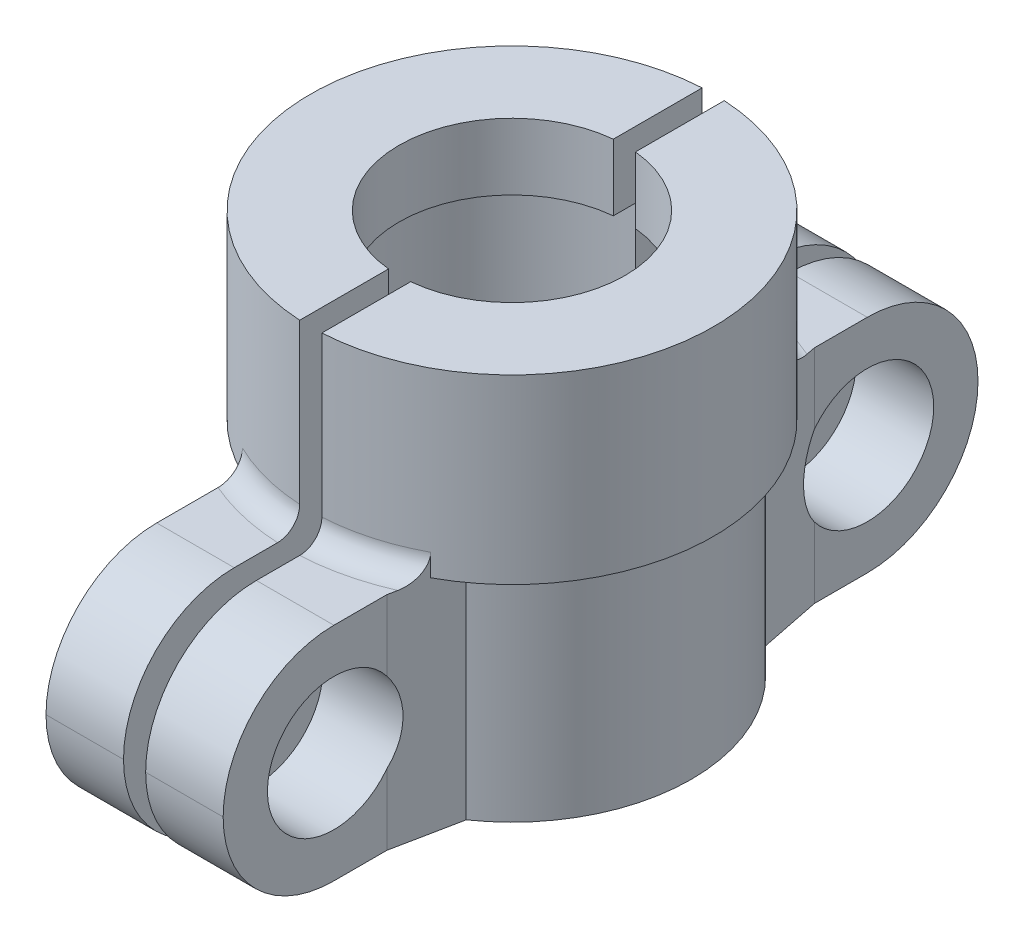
ISO-10303-21;
HEADER;
FILE_DESCRIPTION(('STEP AP214'),'2;1');
FILE_NAME('part.step','',(''),(''),'','','');
FILE_SCHEMA(('AUTOMOTIVE_DESIGN { 1 0 10303 214 1 1 1 1 }'));
ENDSEC;
DATA;
#1=APPLICATION_CONTEXT('core data for automotive mechanical design processes');
#2=APPLICATION_PROTOCOL_DEFINITION('international standard','automotive_design',2000,#1);
#3=PRODUCT_CONTEXT('',#1,'mechanical');
#4=PRODUCT('Part','Part','',(#3));
#5=PRODUCT_RELATED_PRODUCT_CATEGORY('part','',(#4));
#6=PRODUCT_DEFINITION_FORMATION('','',#4);
#7=PRODUCT_DEFINITION_CONTEXT('part definition',#1,'design');
#8=PRODUCT_DEFINITION('design','',#6,#7);
#9=PRODUCT_DEFINITION_SHAPE('','',#8);
#10=(LENGTH_UNIT() NAMED_UNIT(*) SI_UNIT(.MILLI.,.METRE.));
#11=(NAMED_UNIT(*) PLANE_ANGLE_UNIT() SI_UNIT($,.RADIAN.));
#12=(NAMED_UNIT(*) SI_UNIT($,.STERADIAN.) SOLID_ANGLE_UNIT());
#13=UNCERTAINTY_MEASURE_WITH_UNIT(LENGTH_MEASURE(1.E-05),#10,'distance_accuracy_value','');
#14=(GEOMETRIC_REPRESENTATION_CONTEXT(3) GLOBAL_UNCERTAINTY_ASSIGNED_CONTEXT((#13)) GLOBAL_UNIT_ASSIGNED_CONTEXT((#10,
#11,#12)) REPRESENTATION_CONTEXT('',''));
#15=CARTESIAN_POINT('',(0.,0.,0.));
#16=DIRECTION('',(0.,0.,1.));
#17=DIRECTION('',(1.,0.,0.));
#18=AXIS2_PLACEMENT_3D('',#15,#16,#17);
#19=CARTESIAN_POINT('',(0.,9.1,0.));
#20=DIRECTION('',(0.,-1.,0.));
#21=DIRECTION('',(0.,0.,-1.));
#22=AXIS2_PLACEMENT_3D('',#19,#20,#21);
#23=CYLINDRICAL_SURFACE('',#22,4.55);
#24=CARTESIAN_POINT('',(0.,9.1,0.));
#25=DIRECTION('',(0.,1.,0.));
#26=DIRECTION('',(0.,0.,1.));
#27=AXIS2_PLACEMENT_3D('',#24,#25,#26);
#28=CIRCLE('',#27,4.55);
#29=CARTESIAN_POINT('',(-0.25,9.1,-4.54312667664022));
#30=VERTEX_POINT('',#29);
#31=CARTESIAN_POINT('',(-0.249999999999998,9.1,4.54312667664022));
#32=VERTEX_POINT('',#31);
#33=EDGE_CURVE('E154',#30,#32,#28,.T.);
#34=ORIENTED_EDGE('',*,*,#33,.F.);
#35=DIRECTION('',(0.,-1.,0.));
#36=VECTOR('',#35,1.);
#37=CARTESIAN_POINT('',(-0.249999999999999,9.1,-4.54312667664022));
#38=LINE('',#37,#36);
#39=CARTESIAN_POINT('',(-0.25,5.5,-4.54312667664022));
#40=VERTEX_POINT('',#39);
#41=EDGE_CURVE('E285',#30,#40,#38,.T.);
#42=ORIENTED_EDGE('',*,*,#41,.T.);
#43=CARTESIAN_POINT('',(0.,5.5,0.));
#44=DIRECTION('',(0.,1.,0.));
#45=DIRECTION('',(0.,0.,1.));
#46=AXIS2_PLACEMENT_3D('',#43,#44,#45);
#47=CIRCLE('',#46,4.55);
#48=CARTESIAN_POINT('',(-2.,5.5,-4.08686921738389));
#49=VERTEX_POINT('',#48);
#50=EDGE_CURVE('E320',#40,#49,#47,.T.);
#51=ORIENTED_EDGE('',*,*,#50,.T.);
#52=DIRECTION('',(0.,-1.,0.));
#53=VECTOR('',#52,1.);
#54=CARTESIAN_POINT('',(-2.,5.5,-4.08686921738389));
#55=LINE('',#54,#53);
#56=CARTESIAN_POINT('',(-2.,5.,-4.08686921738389));
#57=VERTEX_POINT('',#56);
#58=EDGE_CURVE('E256',#49,#57,#55,.T.);
#59=ORIENTED_EDGE('',*,*,#58,.T.);
#60=CARTESIAN_POINT('',(0.,5.,0.));
#61=DIRECTION('',(0.,1.,0.));
#62=DIRECTION('',(0.,0.,1.));
#63=AXIS2_PLACEMENT_3D('',#60,#61,#62);
#64=CIRCLE('',#63,4.55);
#65=CARTESIAN_POINT('',(-2.,5.,4.08686921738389));
#66=VERTEX_POINT('',#65);
#67=EDGE_CURVE('E296',#57,#66,#64,.T.);
#68=ORIENTED_EDGE('',*,*,#67,.T.);
#69=DIRECTION('',(0.,-1.,0.));
#70=VECTOR('',#69,1.);
#71=CARTESIAN_POINT('',(-2.,5.5,4.08686921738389));
#72=LINE('',#71,#70);
#73=CARTESIAN_POINT('',(-2.,5.5,4.08686921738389));
#74=VERTEX_POINT('',#73);
#75=EDGE_CURVE('E332',#74,#66,#72,.T.);
#76=ORIENTED_EDGE('',*,*,#75,.F.);
#77=CARTESIAN_POINT('',(0.,5.5,0.));
#78=DIRECTION('',(0.,-1.,0.));
#79=DIRECTION('',(0.,0.,-1.));
#80=AXIS2_PLACEMENT_3D('',#77,#78,#79);
#81=CIRCLE('',#80,4.55);
#82=CARTESIAN_POINT('',(-0.249999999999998,5.4999999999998,4.54312667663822));
#83=VERTEX_POINT('',#82);
#84=EDGE_CURVE('E184',#83,#74,#81,.T.);
#85=ORIENTED_EDGE('',*,*,#84,.F.);
#86=DIRECTION('',(0.,-1.,0.));
#87=VECTOR('',#86,1.);
#88=CARTESIAN_POINT('',(-0.249999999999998,9.1,4.54312667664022));
#89=LINE('',#88,#87);
#90=EDGE_CURVE('E287',#83,#32,#89,.F.);
#91=ORIENTED_EDGE('',*,*,#90,.T.);
#92=EDGE_LOOP('',(#34,#42,#51,#59,#68,#76,#85,#91));
#93=FACE_BOUND('',#92,.T.);
#94=ADVANCED_FACE('F51',(#93),#23,.T.);
#95=CARTESIAN_POINT('',(0.,9.1,0.));
#96=DIRECTION('',(0.,-1.,0.));
#97=DIRECTION('',(0.,0.,-1.));
#98=AXIS2_PLACEMENT_3D('',#95,#96,#97);
#99=CYLINDRICAL_SURFACE('',#98,3.05);
#100=DIRECTION('',(0.,-1.,0.));
#101=VECTOR('',#100,1.);
#102=CARTESIAN_POINT('',(-0.249999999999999,9.1,-3.03973683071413));
#103=LINE('',#102,#101);
#104=CARTESIAN_POINT('',(-0.249999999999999,7.6,-3.03973683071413));
#105=VERTEX_POINT('',#104);
#106=CARTESIAN_POINT('',(-0.249999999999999,5.,-3.03973683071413));
#107=VERTEX_POINT('',#106);
#108=EDGE_CURVE('E310',#105,#107,#103,.T.);
#109=ORIENTED_EDGE('',*,*,#108,.F.);
#110=CARTESIAN_POINT('',(0.,7.6,0.));
#111=DIRECTION('',(0.,1.,0.));
#112=DIRECTION('',(0.,0.,1.));
#113=AXIS2_PLACEMENT_3D('',#110,#111,#112);
#114=CIRCLE('',#113,3.05);
#115=CARTESIAN_POINT('',(-0.249999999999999,7.6,3.03973683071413));
#116=VERTEX_POINT('',#115);
#117=EDGE_CURVE('E302',#105,#116,#114,.T.);
#118=ORIENTED_EDGE('',*,*,#117,.T.);
#119=DIRECTION('',(0.,-1.,0.));
#120=VECTOR('',#119,1.);
#121=CARTESIAN_POINT('',(-0.249999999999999,9.1,3.03973683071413));
#122=LINE('',#121,#120);
#123=CARTESIAN_POINT('',(-0.249999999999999,5.,3.03973683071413));
#124=VERTEX_POINT('',#123);
#125=EDGE_CURVE('E309',#124,#116,#122,.F.);
#126=ORIENTED_EDGE('',*,*,#125,.F.);
#127=CARTESIAN_POINT('',(0.,5.,0.));
#128=DIRECTION('',(0.,1.,0.));
#129=DIRECTION('',(0.,0.,1.));
#130=AXIS2_PLACEMENT_3D('',#127,#128,#129);
#131=CIRCLE('',#130,3.05);
#132=EDGE_CURVE('E299',#107,#124,#131,.T.);
#133=ORIENTED_EDGE('',*,*,#132,.F.);
#134=EDGE_LOOP('',(#109,#118,#126,#133));
#135=FACE_BOUND('',#134,.T.);
#136=ADVANCED_FACE('F275',(#135),#99,.F.);
#137=CARTESIAN_POINT('',(0.,5.,0.));
#138=DIRECTION('',(0.,1.,0.));
#139=DIRECTION('',(0.,0.,1.));
#140=AXIS2_PLACEMENT_3D('',#137,#138,#139);
#141=PLANE('',#140);
#142=DIRECTION('',(0.,0.,1.));
#143=VECTOR('',#142,1.);
#144=CARTESIAN_POINT('',(-0.249999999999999,5.,0.));
#145=LINE('',#144,#143);
#146=CARTESIAN_POINT('',(-0.249999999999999,5.,-2.5377155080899));
#147=VERTEX_POINT('',#146);
#148=EDGE_CURVE('E312',#107,#147,#145,.T.);
#149=ORIENTED_EDGE('',*,*,#148,.F.);
#150=ORIENTED_EDGE('',*,*,#132,.T.);
#151=CARTESIAN_POINT('',(-0.249999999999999,5.,2.5377155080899));
#152=VERTEX_POINT('',#151);
#153=EDGE_CURVE('E311',#152,#124,#145,.T.);
#154=ORIENTED_EDGE('',*,*,#153,.F.);
#155=CARTESIAN_POINT('',(0.,5.,0.));
#156=DIRECTION('',(0.,1.,0.));
#157=DIRECTION('',(0.,0.,1.));
#158=AXIS2_PLACEMENT_3D('',#155,#156,#157);
#159=CIRCLE('',#158,2.55);
#160=EDGE_CURVE('E288',#147,#152,#159,.T.);
#161=ORIENTED_EDGE('',*,*,#160,.F.);
#162=EDGE_LOOP('',(#149,#150,#154,#161));
#163=FACE_BOUND('',#162,.T.);
#164=ADVANCED_FACE('F280',(#163),#141,.T.);
#165=CARTESIAN_POINT('',(0.,0.,0.));
#166=DIRECTION('',(0.,1.,0.));
#167=DIRECTION('',(0.,0.,1.));
#168=AXIS2_PLACEMENT_3D('',#165,#166,#167);
#169=PLANE('',#168);
#170=DIRECTION('',(-1.,0.,0.));
#171=VECTOR('',#170,1.);
#172=CARTESIAN_POINT('',(0.,0.,-6.02171833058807));
#173=LINE('',#172,#171);
#174=CARTESIAN_POINT('',(-2.,0.,-6.02171833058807));
#175=VERTEX_POINT('',#174);
#176=CARTESIAN_POINT('',(-0.249999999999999,0.,-6.02171833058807));
#177=VERTEX_POINT('',#176);
#178=EDGE_CURVE('E301',#175,#177,#173,.F.);
#179=ORIENTED_EDGE('',*,*,#178,.T.);
#180=DIRECTION('',(0.,0.,1.));
#181=VECTOR('',#180,1.);
#182=CARTESIAN_POINT('',(-0.249999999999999,0.,0.));
#183=LINE('',#182,#181);
#184=CARTESIAN_POINT('',(-0.249999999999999,0.,-2.5377155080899));
#185=VERTEX_POINT('',#184);
#186=EDGE_CURVE('E417',#177,#185,#183,.T.);
#187=ORIENTED_EDGE('',*,*,#186,.T.);
#188=CARTESIAN_POINT('',(0.,0.,0.));
#189=DIRECTION('',(0.,1.,0.));
#190=DIRECTION('',(0.,0.,1.));
#191=AXIS2_PLACEMENT_3D('',#188,#189,#190);
#192=CIRCLE('',#191,2.55);
#193=CARTESIAN_POINT('',(-0.249999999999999,0.,2.5377155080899));
#194=VERTEX_POINT('',#193);
#195=EDGE_CURVE('E295',#185,#194,#192,.T.);
#196=ORIENTED_EDGE('',*,*,#195,.T.);
#197=CARTESIAN_POINT('',(-0.249999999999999,0.,6.02171833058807));
#198=VERTEX_POINT('',#197);
#199=EDGE_CURVE('E203',#194,#198,#183,.T.);
#200=ORIENTED_EDGE('',*,*,#199,.T.);
#201=DIRECTION('',(-1.,0.,0.));
#202=VECTOR('',#201,1.);
#203=CARTESIAN_POINT('',(0.,0.,6.02171833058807));
#204=LINE('',#203,#202);
#205=CARTESIAN_POINT('',(-2.,0.,6.02171833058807));
#206=VERTEX_POINT('',#205);
#207=EDGE_CURVE('E175',#206,#198,#204,.F.);
#208=ORIENTED_EDGE('',*,*,#207,.F.);
#209=DIRECTION('',(0.,0.,-1.));
#210=VECTOR('',#209,1.);
#211=CARTESIAN_POINT('',(-2.,0.,3.52171833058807));
#212=LINE('',#211,#210);
#213=CARTESIAN_POINT('',(-2.,0.,3.79517712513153));
#214=VERTEX_POINT('',#213);
#215=EDGE_CURVE('E326',#206,#214,#212,.T.);
#216=ORIENTED_EDGE('',*,*,#215,.T.);
#217=DIRECTION('',(0.680204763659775,0.,0.733022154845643));
#218=VECTOR('',#217,1.);
#219=CARTESIAN_POINT('',(-2.96693786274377,0.,2.75315726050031));
#220=LINE('',#219,#218);
#221=CARTESIAN_POINT('',(-2.87097155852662,0.,2.85657527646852));
#222=VERTEX_POINT('',#221);
#223=EDGE_CURVE('E350',#222,#214,#220,.T.);
#224=ORIENTED_EDGE('',*,*,#223,.F.);
#225=CARTESIAN_POINT('',(0.,0.,0.));
#226=DIRECTION('',(0.,1.,0.));
#227=DIRECTION('',(0.,0.,1.));
#228=AXIS2_PLACEMENT_3D('',#225,#226,#227);
#229=CIRCLE('',#228,4.05);
#230=CARTESIAN_POINT('',(-2.87097155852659,0.,-2.85657527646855));
#231=VERTEX_POINT('',#230);
#232=EDGE_CURVE('E379',#231,#222,#229,.T.);
#233=ORIENTED_EDGE('',*,*,#232,.F.);
#234=DIRECTION('',(0.680204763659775,0.,-0.733022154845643));
#235=VECTOR('',#234,1.);
#236=CARTESIAN_POINT('',(-2.96693786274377,0.,-2.75315726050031));
#237=LINE('',#236,#235);
#238=CARTESIAN_POINT('',(-2.,0.,-3.79517712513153));
#239=VERTEX_POINT('',#238);
#240=EDGE_CURVE('E291',#231,#239,#237,.T.);
#241=ORIENTED_EDGE('',*,*,#240,.T.);
#242=DIRECTION('',(0.,0.,1.));
#243=VECTOR('',#242,1.);
#244=CARTESIAN_POINT('',(-2.,0.,-3.52171833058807));
#245=LINE('',#244,#243);
#246=EDGE_CURVE('E357',#175,#239,#245,.T.);
#247=ORIENTED_EDGE('',*,*,#246,.F.);
#248=EDGE_LOOP('',(#179,#187,#196,#200,#208,#216,#224,#233,#241,#247));
#249=FACE_BOUND('',#248,.T.);
#250=ADVANCED_FACE('F494',(#249),#169,.F.);
#251=CARTESIAN_POINT('',(0.,5.,0.));
#252=DIRECTION('',(0.,-1.,0.));
#253=DIRECTION('',(0.,0.,-1.));
#254=AXIS2_PLACEMENT_3D('',#251,#252,#253);
#255=CYLINDRICAL_SURFACE('',#254,2.55);
#256=DIRECTION('',(0.,-1.,0.));
#257=VECTOR('',#256,1.);
#258=CARTESIAN_POINT('',(-0.249999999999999,5.,-2.5377155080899));
#259=LINE('',#258,#257);
#260=EDGE_CURVE('E229',#147,#185,#259,.T.);
#261=ORIENTED_EDGE('',*,*,#260,.F.);
#262=ORIENTED_EDGE('',*,*,#160,.T.);
#263=DIRECTION('',(0.,-1.,0.));
#264=VECTOR('',#263,1.);
#265=CARTESIAN_POINT('',(-0.249999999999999,5.,2.5377155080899));
#266=LINE('',#265,#264);
#267=EDGE_CURVE('E201',#194,#152,#266,.F.);
#268=ORIENTED_EDGE('',*,*,#267,.F.);
#269=ORIENTED_EDGE('',*,*,#195,.F.);
#270=EDGE_LOOP('',(#261,#262,#268,#269));
#271=FACE_BOUND('',#270,.T.);
#272=ADVANCED_FACE('F499',(#271),#255,.F.);
#273=CARTESIAN_POINT('',(0.,9.1,0.));
#274=DIRECTION('',(0.,1.,0.));
#275=DIRECTION('',(0.,0.,1.));
#276=AXIS2_PLACEMENT_3D('',#273,#274,#275);
#277=PLANE('',#276);
#278=DIRECTION('',(0.,0.,1.));
#279=VECTOR('',#278,1.);
#280=CARTESIAN_POINT('',(-0.25,9.1,-8.52171833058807));
#281=LINE('',#280,#279);
#282=CARTESIAN_POINT('',(-0.249999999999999,9.1,-2.5377155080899));
#283=VERTEX_POINT('',#282);
#284=EDGE_CURVE('E12',#30,#283,#281,.T.);
#285=ORIENTED_EDGE('',*,*,#284,.F.);
#286=ORIENTED_EDGE('',*,*,#33,.T.);
#287=CARTESIAN_POINT('',(-0.249999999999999,9.1,2.5377155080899));
#288=VERTEX_POINT('',#287);
#289=EDGE_CURVE('E62',#288,#32,#281,.T.);
#290=ORIENTED_EDGE('',*,*,#289,.F.);
#291=CARTESIAN_POINT('',(0.,9.1,0.));
#292=DIRECTION('',(0.,1.,0.));
#293=DIRECTION('',(0.,0.,1.));
#294=AXIS2_PLACEMENT_3D('',#291,#292,#293);
#295=CIRCLE('',#294,2.55);
#296=EDGE_CURVE('E146',#283,#288,#295,.T.);
#297=ORIENTED_EDGE('',*,*,#296,.F.);
#298=EDGE_LOOP('',(#285,#286,#290,#297));
#299=FACE_BOUND('',#298,.T.);
#300=ADVANCED_FACE('F152',(#299),#277,.T.);
#301=CARTESIAN_POINT('',(0.,7.6,0.));
#302=DIRECTION('',(0.,1.,0.));
#303=DIRECTION('',(0.,0.,1.));
#304=AXIS2_PLACEMENT_3D('',#301,#302,#303);
#305=PLANE('',#304);
#306=ORIENTED_EDGE('',*,*,#117,.F.);
#307=DIRECTION('',(0.,0.,1.));
#308=VECTOR('',#307,1.);
#309=CARTESIAN_POINT('',(-0.249999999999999,7.6,0.));
#310=LINE('',#309,#308);
#311=CARTESIAN_POINT('',(-0.249999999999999,7.6,-2.5377155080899));
#312=VERTEX_POINT('',#311);
#313=EDGE_CURVE('E161',#105,#312,#310,.T.);
#314=ORIENTED_EDGE('',*,*,#313,.T.);
#315=CARTESIAN_POINT('',(0.,7.6,0.));
#316=DIRECTION('',(0.,1.,0.));
#317=DIRECTION('',(0.,0.,1.));
#318=AXIS2_PLACEMENT_3D('',#315,#316,#317);
#319=CIRCLE('',#318,2.55);
#320=CARTESIAN_POINT('',(-0.249999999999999,7.6,2.5377155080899));
#321=VERTEX_POINT('',#320);
#322=EDGE_CURVE('E159',#312,#321,#319,.T.);
#323=ORIENTED_EDGE('',*,*,#322,.T.);
#324=EDGE_CURVE('E141',#321,#116,#310,.T.);
#325=ORIENTED_EDGE('',*,*,#324,.T.);
#326=EDGE_LOOP('',(#306,#314,#323,#325));
#327=FACE_BOUND('',#326,.T.);
#328=ADVANCED_FACE('F504',(#327),#305,.F.);
#329=CARTESIAN_POINT('',(0.,7.6,0.));
#330=DIRECTION('',(0.,1.,0.));
#331=DIRECTION('',(0.,0.,1.));
#332=AXIS2_PLACEMENT_3D('',#329,#330,#331);
#333=CYLINDRICAL_SURFACE('',#332,2.55);
#334=ORIENTED_EDGE('',*,*,#296,.T.);
#335=DIRECTION('',(0.,1.,0.));
#336=VECTOR('',#335,1.);
#337=CARTESIAN_POINT('',(-0.249999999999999,7.6,2.5377155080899));
#338=LINE('',#337,#336);
#339=EDGE_CURVE('E135',#288,#321,#338,.F.);
#340=ORIENTED_EDGE('',*,*,#339,.T.);
#341=ORIENTED_EDGE('',*,*,#322,.F.);
#342=DIRECTION('',(0.,1.,0.));
#343=VECTOR('',#342,1.);
#344=CARTESIAN_POINT('',(-0.249999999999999,7.6,-2.5377155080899));
#345=LINE('',#344,#343);
#346=EDGE_CURVE('E69',#312,#283,#345,.T.);
#347=ORIENTED_EDGE('',*,*,#346,.T.);
#348=EDGE_LOOP('',(#334,#340,#341,#347));
#349=FACE_BOUND('',#348,.T.);
#350=ADVANCED_FACE('F157',(#349),#333,.F.);
#351=CARTESIAN_POINT('',(0.,5.,0.));
#352=DIRECTION('',(0.,1.,0.));
#353=DIRECTION('',(0.,0.,1.));
#354=AXIS2_PLACEMENT_3D('',#351,#352,#353);
#355=PLANE('',#354);
#356=DIRECTION('',(0.,0.,1.));
#357=VECTOR('',#356,1.);
#358=CARTESIAN_POINT('',(-0.249999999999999,5.,0.));
#359=LINE('',#358,#357);
#360=CARTESIAN_POINT('',(-0.25,5.,-6.02171833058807));
#361=VERTEX_POINT('',#360);
#362=CARTESIAN_POINT('',(-0.25,5.,-5.0438080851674));
#363=VERTEX_POINT('',#362);
#364=EDGE_CURVE('E60',#361,#363,#359,.T.);
#365=ORIENTED_EDGE('',*,*,#364,.F.);
#366=DIRECTION('',(-1.,0.,0.));
#367=VECTOR('',#366,1.);
#368=CARTESIAN_POINT('',(-2.,5.,-6.02171833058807));
#369=LINE('',#368,#367);
#370=CARTESIAN_POINT('',(-2.,5.,-6.02171833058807));
#371=VERTEX_POINT('',#370);
#372=EDGE_CURVE('E322',#361,#371,#369,.T.);
#373=ORIENTED_EDGE('',*,*,#372,.T.);
#374=DIRECTION('',(0.,0.,1.));
#375=VECTOR('',#374,1.);
#376=CARTESIAN_POINT('',(-2.,5.,-3.52171833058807));
#377=LINE('',#376,#375);
#378=CARTESIAN_POINT('',(-2.,5.,-4.63707882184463));
#379=VERTEX_POINT('',#378);
#380=EDGE_CURVE('E361',#371,#379,#377,.T.);
#381=ORIENTED_EDGE('',*,*,#380,.T.);
#382=CARTESIAN_POINT('',(0.,5.,0.));
#383=DIRECTION('',(0.,1.,0.));
#384=DIRECTION('',(0.,0.,1.));
#385=AXIS2_PLACEMENT_3D('',#382,#383,#384);
#386=CIRCLE('',#385,5.05);
#387=EDGE_CURVE('E325',#379,#363,#386,.F.);
#388=ORIENTED_EDGE('',*,*,#387,.T.);
#389=EDGE_LOOP('',(#365,#373,#381,#388));
#390=FACE_BOUND('',#389,.T.);
#391=ADVANCED_FACE('F241',(#390),#355,.T.);
#392=CARTESIAN_POINT('',(-8.,2.5,-6.02171833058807));
#393=DIRECTION('',(1.,0.,0.));
#394=DIRECTION('',(0.,0.,-1.));
#395=AXIS2_PLACEMENT_3D('',#392,#393,#394);
#396=CYLINDRICAL_SURFACE('',#395,1.5);
#397=CARTESIAN_POINT('',(-0.25,2.5,-6.02171833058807));
#398=DIRECTION('',(-1.,0.,0.));
#399=DIRECTION('',(0.,0.,1.));
#400=AXIS2_PLACEMENT_3D('',#397,#398,#399);
#401=CIRCLE('',#400,1.5);
#402=CARTESIAN_POINT('',(-0.25,2.5,-4.52171833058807));
#403=VERTEX_POINT('',#402);
#404=EDGE_CURVE('E228',#403,#403,#401,.F.);
#405=ORIENTED_EDGE('',*,*,#404,.T.);
#406=EDGE_LOOP('',(#405));
#407=FACE_BOUND('',#406,.T.);
#408=CARTESIAN_POINT('',(-2.,2.5,-6.02171833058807));
#409=DIRECTION('',(1.,0.,0.));
#410=DIRECTION('',(0.,0.,-1.));
#411=AXIS2_PLACEMENT_3D('',#408,#409,#410);
#412=CIRCLE('',#411,1.5);
#413=CARTESIAN_POINT('',(-2.,2.5,-7.52171833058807));
#414=VERTEX_POINT('',#413);
#415=EDGE_CURVE('E360',#414,#414,#412,.T.);
#416=ORIENTED_EDGE('',*,*,#415,.F.);
#417=EDGE_LOOP('',(#416));
#418=FACE_BOUND('',#417,.T.);
#419=ADVANCED_FACE('F238',(#407,#418),#396,.F.);
#420=CARTESIAN_POINT('',(0.,5.5,0.));
#421=DIRECTION('',(0.,1.,0.));
#422=DIRECTION('',(0.,0.,1.));
#423=AXIS2_PLACEMENT_3D('',#420,#421,#422);
#424=TOROIDAL_SURFACE('',#423,5.05,0.5);
#425=ORIENTED_EDGE('',*,*,#50,.F.);
#426=CARTESIAN_POINT('',(-0.25,5.02494422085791,-4.88765537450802));
#427=CARTESIAN_POINT('',(-0.25,5.01617466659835,-4.91440728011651));
#428=CARTESIAN_POINT('',(-0.25,5.009658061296,-4.94191938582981));
#429=CARTESIAN_POINT('',(-0.25,5.00133099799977,-4.99767023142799));
#430=CARTESIAN_POINT('',(-0.25,4.99952624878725,-5.02590981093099));
#431=CARTESIAN_POINT('',(-0.25,5.0006848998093,-5.08228033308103));
#432=CARTESIAN_POINT('',(-0.25,5.00364604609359,-5.11041132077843));
#433=CARTESIAN_POINT('',(-0.25,5.01424949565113,-5.16576883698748));
#434=CARTESIAN_POINT('',(-0.25,5.02189062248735,-5.19299559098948));
#435=CARTESIAN_POINT('',(-0.25,5.04163645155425,-5.24577655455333));
#436=CARTESIAN_POINT('',(-0.25,5.0537407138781,-5.27133092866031));
#437=CARTESIAN_POINT('',(-0.25,5.08207172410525,-5.32004339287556));
#438=CARTESIAN_POINT('',(-0.25,5.09829862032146,-5.34320139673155));
#439=CARTESIAN_POINT('',(-0.25,5.13439907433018,-5.38644051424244));
#440=CARTESIAN_POINT('',(-0.25,5.15426940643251,-5.40652432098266));
#441=CARTESIAN_POINT('',(-0.25,5.1971029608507,-5.44306651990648));
#442=CARTESIAN_POINT('',(-0.25,5.22006615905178,-5.45952494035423));
#443=CARTESIAN_POINT('',(-0.25,5.26840729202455,-5.4883307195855));
#444=CARTESIAN_POINT('',(-0.25,5.29378262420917,-5.50068244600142));
#445=CARTESIAN_POINT('',(-0.25,5.34624799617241,-5.52094616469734));
#446=CARTESIAN_POINT('',(-0.25,5.37333802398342,-5.52885818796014));
#447=CARTESIAN_POINT('',(-0.25,5.42843856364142,-5.54001149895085));
#448=CARTESIAN_POINT('',(-0.25,5.45644825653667,-5.54325683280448));
#449=CARTESIAN_POINT('',(-0.25,5.51261481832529,-5.54499704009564));
#450=CARTESIAN_POINT('',(-0.25,5.54077168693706,-5.5434919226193));
#451=CARTESIAN_POINT('',(-0.25,5.59642207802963,-5.53577571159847));
#452=CARTESIAN_POINT('',(-0.25,5.62391584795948,-5.52956640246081));
#453=CARTESIAN_POINT('',(-0.25,5.67747103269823,-5.51262111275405));
#454=CARTESIAN_POINT('',(-0.25,5.70353244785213,-5.50188513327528));
#455=CARTESIAN_POINT('',(-0.25,5.75348996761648,-5.47618961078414));
#456=CARTESIAN_POINT('',(-0.25,5.77738558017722,-5.4612291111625));
#457=CARTESIAN_POINT('',(-0.25,5.82232844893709,-5.42751158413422));
#458=CARTESIAN_POINT('',(-0.25,5.84337569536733,-5.40875454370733));
#459=CARTESIAN_POINT('',(-0.25,5.88204198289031,-5.36796154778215));
#460=CARTESIAN_POINT('',(-0.25,5.89965839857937,-5.34592310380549));
#461=CARTESIAN_POINT('',(-0.25,5.93094584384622,-5.29920407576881));
#462=CARTESIAN_POINT('',(-0.25,5.94461685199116,-5.27452347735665));
#463=CARTESIAN_POINT('',(-0.25,5.96764070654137,-5.22319299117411));
#464=CARTESIAN_POINT('',(-0.25,5.97698899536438,-5.19654105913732));
#465=CARTESIAN_POINT('',(-0.25,5.99108321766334,-5.14204685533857));
#466=CARTESIAN_POINT('',(-0.25,5.99582912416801,-5.11420457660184));
#467=CARTESIAN_POINT('',(-0.25,6.00058782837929,-5.05809149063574));
#468=CARTESIAN_POINT('',(-0.25,6.00059608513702,-5.02982029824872));
#469=CARTESIAN_POINT('',(-0.25,5.99586844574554,-4.97367735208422));
#470=CARTESIAN_POINT('',(-0.25,5.99113253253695,-4.94580559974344));
#471=CARTESIAN_POINT('',(-0.25,5.9770472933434,-4.89124001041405));
#472=CARTESIAN_POINT('',(-0.25,5.96769593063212,-4.86454669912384));
#473=CARTESIAN_POINT('',(-0.25,5.94464295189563,-4.81310964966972));
#474=CARTESIAN_POINT('',(-0.25,5.93094133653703,-4.78836591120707));
#475=CARTESIAN_POINT('',(-0.25,5.89958086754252,-4.74154098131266));
#476=CARTESIAN_POINT('',(-0.25,5.88192345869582,-4.7194588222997));
#477=CARTESIAN_POINT('',(-0.25,5.84314821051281,-4.67857650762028));
#478=CARTESIAN_POINT('',(-0.25,5.82203039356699,-4.65977633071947));
#479=CARTESIAN_POINT('',(-0.25,5.77695869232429,-4.62601479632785));
#480=CARTESIAN_POINT('',(-0.25,5.75300801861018,-4.61104915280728));
#481=CARTESIAN_POINT('',(-0.25,5.70293134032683,-4.5853577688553));
#482=CARTESIAN_POINT('',(-0.25,5.67680534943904,-4.57463200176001));
#483=CARTESIAN_POINT('',(-0.25,5.6231588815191,-4.55774021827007));
#484=CARTESIAN_POINT('',(-0.25,5.59564040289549,-4.55156785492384));
#485=CARTESIAN_POINT('',(-0.25,5.53995751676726,-4.54393550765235));
#486=CARTESIAN_POINT('',(-0.25,5.5117931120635,-4.54247550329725));
#487=CARTESIAN_POINT('',(-0.25,5.45564535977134,-4.5443089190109));
#488=CARTESIAN_POINT('',(-0.25,5.42766187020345,-4.54759799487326));
#489=CARTESIAN_POINT('',(-0.25,5.37264538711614,-4.55882719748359));
#490=CARTESIAN_POINT('',(-0.25,5.34561235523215,-4.56676713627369));
#491=CARTESIAN_POINT('',(-0.25,5.29326315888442,-4.58706994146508));
#492=CARTESIAN_POINT('',(-0.25,5.26794692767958,-4.59943263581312));
#493=CARTESIAN_POINT('',(-0.25,5.21973978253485,-4.62823243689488));
#494=CARTESIAN_POINT('',(-0.25,5.19684948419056,-4.64467057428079));
#495=CARTESIAN_POINT('',(-0.25,5.15411697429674,-4.68117564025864));
#496=CARTESIAN_POINT('',(-0.25,5.13427938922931,-4.70124797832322));
#497=CARTESIAN_POINT('',(-0.25,5.09826981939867,-4.74441984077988));
#498=CARTESIAN_POINT('',(-0.25,5.08209348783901,-4.76751572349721));
#499=CARTESIAN_POINT('',(-0.25,5.05914546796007,-4.80695434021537));
#500=CARTESIAN_POINT('',(-0.25,5.05112153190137,-4.82258282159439));
#501=CARTESIAN_POINT('',(-0.25,5.03675457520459,-4.85459416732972));
#502=CARTESIAN_POINT('',(-0.25,5.03041155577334,-4.87097703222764));
#503=CARTESIAN_POINT('',(-0.25,5.02494422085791,-4.88765537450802));
#504=B_SPLINE_CURVE_WITH_KNOTS('',3,(#426,#427,#428,#429,#430,#431,#432,#433,#434,#435,#436,
#437,#438,#439,#440,#441,#442,#443,#444,#445,#446,#447,#448,#449,#450,#451,#452,#453,#454,#455,
#456,#457,#458,#459,#460,#461,#462,#463,#464,#465,#466,#467,#468,#469,#470,#471,#472,#473,#474,
#475,#476,#477,#478,#479,#480,#481,#482,#483,#484,#485,#486,#487,#488,#489,#490,#491,#492,#493,
#494,#495,#496,#497,#498,#499,#500,#501,#502,#503),.UNSPECIFIED.,.T.,.F.,(4,2,2,2,2,2,2,2,2,2,2,
2,2,2,2,2,2,2,2,2,2,2,2,2,2,2,2,2,2,2,2,2,2,2,2,2,2,2,4),(0.,0.0843937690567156,
0.16888974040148,0.253345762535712,0.337780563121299,0.422207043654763,0.506636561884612,
0.590991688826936,0.675346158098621,0.759610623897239,0.843874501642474,0.928065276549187,
1.01225589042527,1.09641458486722,1.18057325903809,1.26475100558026,1.34892904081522,
1.43317124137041,1.51741389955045,1.6017451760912,1.68607694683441,1.7704895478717,
1.85490245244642,1.93935264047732,2.02380281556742,2.10822219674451,2.1926410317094,
2.27696509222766,2.36128862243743,2.44549439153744,2.52969979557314,2.61382822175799,
2.69795324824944,2.7820750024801,2.86621805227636,2.95048739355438,3.03465615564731,
3.08727099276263,3.13988586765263),.UNSPECIFIED.);
#505=EDGE_CURVE('E169',#40,#363,#504,.T.);
#506=ORIENTED_EDGE('',*,*,#505,.T.);
#507=ORIENTED_EDGE('',*,*,#387,.F.);
#508=CARTESIAN_POINT('',(-2.,5.5,-4.08686921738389));
#509=CARTESIAN_POINT('',(-2.,5.47385031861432,-4.08683296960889));
#510=CARTESIAN_POINT('',(-2.,5.44772618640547,-4.0891506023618));
#511=CARTESIAN_POINT('',(-2.,5.3963499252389,-4.09820255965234));
#512=CARTESIAN_POINT('',(-2.,5.37109493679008,-4.1049205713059));
#513=CARTESIAN_POINT('',(-2.,5.32208986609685,-4.12248050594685));
#514=CARTESIAN_POINT('',(-2.,5.29833884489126,-4.13331982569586));
#515=CARTESIAN_POINT('',(-2.,5.2528758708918,-4.15866856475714));
#516=CARTESIAN_POINT('',(-2.,5.23116530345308,-4.17318045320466));
#517=CARTESIAN_POINT('',(-2.,5.189334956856,-4.20606314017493));
#518=CARTESIAN_POINT('',(-2.,5.16932645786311,-4.2245750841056));
#519=CARTESIAN_POINT('',(-2.,5.1323690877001,-4.26442917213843));
#520=CARTESIAN_POINT('',(-2.,5.11542110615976,-4.28577213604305));
#521=CARTESIAN_POINT('',(-2.,5.08336142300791,-4.33285984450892));
#522=CARTESIAN_POINT('',(-2.,5.06858144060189,-4.35883041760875));
#523=CARTESIAN_POINT('',(-2.,5.04320506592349,-4.4127470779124));
#524=CARTESIAN_POINT('',(-2.,5.03261073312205,-4.44069412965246));
#525=CARTESIAN_POINT('',(-2.,5.01616695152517,-4.4964919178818));
#526=CARTESIAN_POINT('',(-2.,5.0101146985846,-4.52428326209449));
#527=CARTESIAN_POINT('',(-2.,5.00203088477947,-4.58040903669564));
#528=CARTESIAN_POINT('',(-2.,4.99999427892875,-4.60874274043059));
#529=CARTESIAN_POINT('',(-2.,5.,-4.63707882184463));
#530=B_SPLINE_CURVE_WITH_KNOTS('',3,(#508,#509,#510,#511,#512,#513,#514,#515,#516,#517,#518,
#519,#520,#521,#522,#523,#524,#525,#526,#527,#528,#529),.UNSPECIFIED.,.F.,.F.,(4,2,2,2,2,2,2,2,
2,2,4),(0.,0.078306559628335,0.156324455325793,0.234293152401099,0.312314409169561,
0.393751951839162,0.475213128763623,0.564482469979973,0.653795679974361,0.738834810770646,
0.823767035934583),.UNSPECIFIED.);
#531=EDGE_CURVE('E244',#49,#379,#530,.T.);
#532=ORIENTED_EDGE('',*,*,#531,.F.);
#533=EDGE_LOOP('',(#425,#506,#507,#532));
#534=FACE_BOUND('',#533,.T.);
#535=ADVANCED_FACE('F232',(#534),#424,.F.);
#536=CARTESIAN_POINT('',(0.,2.5,-6.02171833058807));
#537=DIRECTION('',(1.,0.,0.));
#538=DIRECTION('',(0.,0.,-1.));
#539=AXIS2_PLACEMENT_3D('',#536,#537,#538);
#540=CYLINDRICAL_SURFACE('',#539,2.5);
#541=CARTESIAN_POINT('',(-0.25,2.5,-6.02171833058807));
#542=DIRECTION('',(-1.,0.,0.));
#543=DIRECTION('',(0.,0.,1.));
#544=AXIS2_PLACEMENT_3D('',#541,#542,#543);
#545=CIRCLE('',#544,2.5);
#546=CARTESIAN_POINT('',(-0.25,2.5,-8.52171833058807));
#547=VERTEX_POINT('',#546);
#548=EDGE_CURVE('E408',#547,#361,#545,.F.);
#549=ORIENTED_EDGE('',*,*,#548,.F.);
#550=DIRECTION('',(-1.,0.,0.));
#551=VECTOR('',#550,1.);
#552=CARTESIAN_POINT('',(2.,2.5,-8.52171833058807));
#553=LINE('',#552,#551);
#554=CARTESIAN_POINT('',(-2.,2.5,-8.52171833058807));
#555=VERTEX_POINT('',#554);
#556=EDGE_CURVE('E165',#555,#547,#553,.F.);
#557=ORIENTED_EDGE('',*,*,#556,.F.);
#558=CARTESIAN_POINT('',(-2.,2.5,-6.02171833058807));
#559=DIRECTION('',(1.,0.,0.));
#560=DIRECTION('',(0.,0.,-1.));
#561=AXIS2_PLACEMENT_3D('',#558,#559,#560);
#562=CIRCLE('',#561,2.5);
#563=EDGE_CURVE('E253',#371,#555,#562,.F.);
#564=ORIENTED_EDGE('',*,*,#563,.F.);
#565=ORIENTED_EDGE('',*,*,#372,.F.);
#566=EDGE_LOOP('',(#549,#557,#564,#565));
#567=FACE_BOUND('',#566,.T.);
#568=ADVANCED_FACE('F237',(#567),#540,.T.);
#569=CARTESIAN_POINT('',(2.,2.5,-6.02171833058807));
#570=DIRECTION('',(-1.,0.,0.));
#571=DIRECTION('',(0.,0.,1.));
#572=AXIS2_PLACEMENT_3D('',#569,#570,#571);
#573=CYLINDRICAL_SURFACE('',#572,2.5);
#574=CARTESIAN_POINT('',(-0.25,2.5,-6.02171833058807));
#575=DIRECTION('',(-1.,0.,0.));
#576=DIRECTION('',(0.,0.,1.));
#577=AXIS2_PLACEMENT_3D('',#574,#575,#576);
#578=CIRCLE('',#577,2.5);
#579=EDGE_CURVE('E317',#177,#547,#578,.F.);
#580=ORIENTED_EDGE('',*,*,#579,.F.);
#581=ORIENTED_EDGE('',*,*,#178,.F.);
#582=CARTESIAN_POINT('',(-2.,2.5,-6.02171833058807));
#583=DIRECTION('',(1.,0.,0.));
#584=DIRECTION('',(0.,0.,-1.));
#585=AXIS2_PLACEMENT_3D('',#582,#583,#584);
#586=CIRCLE('',#585,2.5);
#587=EDGE_CURVE('E333',#555,#175,#586,.F.);
#588=ORIENTED_EDGE('',*,*,#587,.F.);
#589=ORIENTED_EDGE('',*,*,#556,.T.);
#590=EDGE_LOOP('',(#580,#581,#588,#589));
#591=FACE_BOUND('',#590,.T.);
#592=ADVANCED_FACE('F412',(#591),#573,.T.);
#593=CARTESIAN_POINT('',(0.,5.,0.));
#594=DIRECTION('',(0.,1.,0.));
#595=DIRECTION('',(0.,0.,-1.));
#596=AXIS2_PLACEMENT_3D('',#593,#594,#595);
#597=PLANE('',#596);
#598=DIRECTION('',(0.,0.,1.));
#599=VECTOR('',#598,1.);
#600=CARTESIAN_POINT('',(-0.249999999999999,5.,0.));
#601=LINE('',#600,#599);
#602=CARTESIAN_POINT('',(-0.249999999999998,5.,5.0438080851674));
#603=VERTEX_POINT('',#602);
#604=CARTESIAN_POINT('',(-0.249999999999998,5.,6.02171833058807));
#605=VERTEX_POINT('',#604);
#606=EDGE_CURVE('E155',#603,#605,#601,.T.);
#607=ORIENTED_EDGE('',*,*,#606,.F.);
#608=CARTESIAN_POINT('',(0.,5.,0.));
#609=DIRECTION('',(0.,-1.,0.));
#610=DIRECTION('',(0.,0.,-1.));
#611=AXIS2_PLACEMENT_3D('',#608,#609,#610);
#612=CIRCLE('',#611,5.05);
#613=CARTESIAN_POINT('',(-2.,5.,4.63707882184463));
#614=VERTEX_POINT('',#613);
#615=EDGE_CURVE('E180',#614,#603,#612,.F.);
#616=ORIENTED_EDGE('',*,*,#615,.F.);
#617=DIRECTION('',(0.,0.,-1.));
#618=VECTOR('',#617,1.);
#619=CARTESIAN_POINT('',(-2.,5.,3.52171833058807));
#620=LINE('',#619,#618);
#621=CARTESIAN_POINT('',(-2.,5.,6.02171833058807));
#622=VERTEX_POINT('',#621);
#623=EDGE_CURVE('E329',#622,#614,#620,.T.);
#624=ORIENTED_EDGE('',*,*,#623,.F.);
#625=DIRECTION('',(-1.,0.,0.));
#626=VECTOR('',#625,1.);
#627=CARTESIAN_POINT('',(-2.,5.,6.02171833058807));
#628=LINE('',#627,#626);
#629=EDGE_CURVE('E170',#605,#622,#628,.T.);
#630=ORIENTED_EDGE('',*,*,#629,.F.);
#631=EDGE_LOOP('',(#607,#616,#624,#630));
#632=FACE_BOUND('',#631,.T.);
#633=ADVANCED_FACE('F488',(#632),#597,.T.);
#634=CARTESIAN_POINT('',(-8.,2.5,6.02171833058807));
#635=DIRECTION('',(1.,0.,0.));
#636=DIRECTION('',(0.,0.,1.));
#637=AXIS2_PLACEMENT_3D('',#634,#635,#636);
#638=CYLINDRICAL_SURFACE('',#637,1.5);
#639=CARTESIAN_POINT('',(-0.249999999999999,2.5,6.02171833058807));
#640=DIRECTION('',(-1.,0.,0.));
#641=DIRECTION('',(0.,0.,1.));
#642=AXIS2_PLACEMENT_3D('',#639,#640,#641);
#643=CIRCLE('',#642,1.5);
#644=CARTESIAN_POINT('',(-0.249999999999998,2.5,7.52171833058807));
#645=VERTEX_POINT('',#644);
#646=EDGE_CURVE('E168',#645,#645,#643,.F.);
#647=ORIENTED_EDGE('',*,*,#646,.T.);
#648=EDGE_LOOP('',(#647));
#649=FACE_BOUND('',#648,.T.);
#650=CARTESIAN_POINT('',(-2.,2.5,6.02171833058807));
#651=DIRECTION('',(-1.,0.,0.));
#652=DIRECTION('',(0.,0.,1.));
#653=AXIS2_PLACEMENT_3D('',#650,#651,#652);
#654=CIRCLE('',#653,1.5);
#655=CARTESIAN_POINT('',(-2.,2.5,7.52171833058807));
#656=VERTEX_POINT('',#655);
#657=EDGE_CURVE('E183',#656,#656,#654,.T.);
#658=ORIENTED_EDGE('',*,*,#657,.T.);
#659=EDGE_LOOP('',(#658));
#660=FACE_BOUND('',#659,.T.);
#661=ADVANCED_FACE('F515',(#649,#660),#638,.F.);
#662=CARTESIAN_POINT('',(0.,5.5,0.));
#663=DIRECTION('',(0.,1.,0.));
#664=DIRECTION('',(0.,0.,-1.));
#665=AXIS2_PLACEMENT_3D('',#662,#663,#664);
#666=TOROIDAL_SURFACE('',#665,5.05,0.5);
#667=ORIENTED_EDGE('',*,*,#615,.T.);
#668=CARTESIAN_POINT('',(-0.249999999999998,5.14942210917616,4.68683306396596));
#669=CARTESIAN_POINT('',(-0.249999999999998,5.16942850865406,4.66713299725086));
#670=CARTESIAN_POINT('',(-0.249999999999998,5.1911112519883,4.64910643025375));
#671=CARTESIAN_POINT('',(-0.249999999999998,5.23721292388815,4.61693366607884));
#672=CARTESIAN_POINT('',(-0.249999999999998,5.26163507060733,4.60279210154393));
#673=CARTESIAN_POINT('',(-0.249999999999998,5.31249993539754,4.57881708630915));
#674=CARTESIAN_POINT('',(-0.249999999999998,5.33894179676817,4.568981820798));
#675=CARTESIAN_POINT('',(-0.249999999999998,5.39309519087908,4.55389743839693));
#676=CARTESIAN_POINT('',(-0.249999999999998,5.42080640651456,4.54864718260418));
#677=CARTESIAN_POINT('',(-0.249999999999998,5.47669611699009,4.54288086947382));
#678=CARTESIAN_POINT('',(-0.249999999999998,5.50487424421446,4.5423612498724));
#679=CARTESIAN_POINT('',(-0.249999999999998,5.56091846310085,4.54606206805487));
#680=CARTESIAN_POINT('',(-0.249999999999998,5.58878454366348,4.55028267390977));
#681=CARTESIAN_POINT('',(-0.249999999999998,5.64340167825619,4.56334054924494));
#682=CARTESIAN_POINT('',(-0.249999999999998,5.67015315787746,4.57217603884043));
#683=CARTESIAN_POINT('',(-0.249999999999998,5.72179449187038,4.59420978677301));
#684=CARTESIAN_POINT('',(-0.249999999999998,5.74668434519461,4.60740804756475));
#685=CARTESIAN_POINT('',(-0.249999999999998,5.7939150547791,4.63780115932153));
#686=CARTESIAN_POINT('',(-0.249999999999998,5.81625414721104,4.65499875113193));
#687=CARTESIAN_POINT('',(-0.249999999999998,5.85773287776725,4.69289562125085));
#688=CARTESIAN_POINT('',(-0.249999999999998,5.87687249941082,4.7135949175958));
#689=CARTESIAN_POINT('',(-0.249999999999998,5.91143642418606,4.75793717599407));
#690=CARTESIAN_POINT('',(-0.249999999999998,5.92685572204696,4.7815840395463));
#691=CARTESIAN_POINT('',(-0.249999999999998,5.95351140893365,4.83112827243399));
#692=CARTESIAN_POINT('',(-0.249999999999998,5.96474776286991,4.8570256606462));
#693=CARTESIAN_POINT('',(-0.249999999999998,5.98273260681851,4.91037110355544));
#694=CARTESIAN_POINT('',(-0.249999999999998,5.98947540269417,4.93782107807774));
#695=CARTESIAN_POINT('',(-0.249999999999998,5.99825998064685,4.99346323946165));
#696=CARTESIAN_POINT('',(-0.249999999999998,6.00030174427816,5.02165542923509));
#697=CARTESIAN_POINT('',(-0.249999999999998,5.99962595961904,5.07799992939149));
#698=CARTESIAN_POINT('',(-0.249999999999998,5.99690552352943,5.10615220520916));
#699=CARTESIAN_POINT('',(-0.249999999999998,5.98677585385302,5.16160024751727));
#700=CARTESIAN_POINT('',(-0.249999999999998,5.97936662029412,5.18889601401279));
#701=CARTESIAN_POINT('',(-0.249999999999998,5.96007025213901,5.24184904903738));
#702=CARTESIAN_POINT('',(-0.249999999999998,5.94818413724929,5.26750668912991));
#703=CARTESIAN_POINT('',(-0.249999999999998,5.92026951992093,5.3164599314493));
#704=CARTESIAN_POINT('',(-0.249999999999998,5.90424103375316,5.33975554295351));
#705=CARTESIAN_POINT('',(-0.249999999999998,5.86851084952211,5.38330188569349));
#706=CARTESIAN_POINT('',(-0.249999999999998,5.84881229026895,5.40355519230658));
#707=CARTESIAN_POINT('',(-0.249999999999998,5.80629130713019,5.44046289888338));
#708=CARTESIAN_POINT('',(-0.249999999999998,5.78346890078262,5.45711731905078));
#709=CARTESIAN_POINT('',(-0.249999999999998,5.73537429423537,5.48633570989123));
#710=CARTESIAN_POINT('',(-0.249999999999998,5.71010473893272,5.49890403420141));
#711=CARTESIAN_POINT('',(-0.249999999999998,5.65781296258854,5.51961562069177));
#712=CARTESIAN_POINT('',(-0.249999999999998,5.63079075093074,5.52775890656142));
#713=CARTESIAN_POINT('',(-0.249999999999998,5.5757862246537,5.53938250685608));
#714=CARTESIAN_POINT('',(-0.249999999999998,5.54780477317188,5.542866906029));
#715=CARTESIAN_POINT('',(-0.249999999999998,5.49165416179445,5.54508651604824));
#716=CARTESIAN_POINT('',(-0.249999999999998,5.46348500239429,5.54382173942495));
#717=CARTESIAN_POINT('',(-0.249999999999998,5.40777026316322,5.5365805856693));
#718=CARTESIAN_POINT('',(-0.249999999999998,5.38022444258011,5.53060606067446));
#719=CARTESIAN_POINT('',(-0.249999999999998,5.32652653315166,5.51411820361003));
#720=CARTESIAN_POINT('',(-0.249999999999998,5.30037444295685,5.50360487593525));
#721=CARTESIAN_POINT('',(-0.249999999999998,5.25019992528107,5.47833644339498));
#722=CARTESIAN_POINT('',(-0.249999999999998,5.22617794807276,5.46358044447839));
#723=CARTESIAN_POINT('',(-0.249999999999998,5.18094983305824,5.43024775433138));
#724=CARTESIAN_POINT('',(-0.249999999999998,5.1597437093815,5.41167104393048));
#725=CARTESIAN_POINT('',(-0.249999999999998,5.12073186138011,5.3712098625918));
#726=CARTESIAN_POINT('',(-0.249999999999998,5.10292869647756,5.34932292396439));
#727=CARTESIAN_POINT('',(-0.249999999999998,5.07124497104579,5.30287338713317));
#728=CARTESIAN_POINT('',(-0.249999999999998,5.05736443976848,5.27831076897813));
#729=CARTESIAN_POINT('',(-0.249999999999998,5.03390431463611,5.2271791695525));
#730=CARTESIAN_POINT('',(-0.249999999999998,5.02432932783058,5.20060807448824));
#731=CARTESIAN_POINT('',(-0.249999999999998,5.00977174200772,5.14623739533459));
#732=CARTESIAN_POINT('',(-0.249999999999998,5.00478898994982,5.11843785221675));
#733=CARTESIAN_POINT('',(-0.249999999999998,4.99955249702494,5.06237282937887));
#734=CARTESIAN_POINT('',(-0.249999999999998,4.99930283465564,5.03410696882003));
#735=CARTESIAN_POINT('',(-0.249999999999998,5.00355056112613,4.97792642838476));
#736=CARTESIAN_POINT('',(-0.249999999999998,5.00804914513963,4.95001183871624));
#737=CARTESIAN_POINT('',(-0.249999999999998,5.0216720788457,4.89531007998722));
#738=CARTESIAN_POINT('',(-0.249999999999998,5.03080075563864,4.86852399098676));
#739=CARTESIAN_POINT('',(-0.249999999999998,5.05342311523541,4.81688955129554));
#740=CARTESIAN_POINT('',(-0.249999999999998,5.06691154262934,4.79203891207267));
#741=CARTESIAN_POINT('',(-0.249999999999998,5.09207268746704,4.75376378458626));
#742=CARTESIAN_POINT('',(-0.249999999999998,5.10254520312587,4.73953550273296));
#743=CARTESIAN_POINT('',(-0.249999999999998,5.12493170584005,4.71226206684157));
#744=CARTESIAN_POINT('',(-0.249999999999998,5.13684569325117,4.69921691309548));
#745=CARTESIAN_POINT('',(-0.249999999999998,5.14942210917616,4.68683306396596));
#746=B_SPLINE_CURVE_WITH_KNOTS('',3,(#668,#669,#670,#671,#672,#673,#674,#675,#676,#677,#678,
#679,#680,#681,#682,#683,#684,#685,#686,#687,#688,#689,#690,#691,#692,#693,#694,#695,#696,#697,
#698,#699,#700,#701,#702,#703,#704,#705,#706,#707,#708,#709,#710,#711,#712,#713,#714,#715,#716,
#717,#718,#719,#720,#721,#722,#723,#724,#725,#726,#727,#728,#729,#730,#731,#732,#733,#734,#735,
#736,#737,#738,#739,#740,#741,#742,#743,#744,#745),.UNSPECIFIED.,.T.,.F.,(4,2,2,2,2,2,2,2,2,2,2,
2,2,2,2,2,2,2,2,2,2,2,2,2,2,2,2,2,2,2,2,2,2,2,2,2,2,2,4),(0.,0.0841683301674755,
0.168436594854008,0.252669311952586,0.336881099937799,0.421029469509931,0.505180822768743,
0.589299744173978,0.673418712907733,0.757595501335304,0.841772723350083,0.926062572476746,
1.01035312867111,1.09475029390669,1.17914779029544,1.26359648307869,1.34804517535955,
1.43247464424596,1.51690378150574,1.60126103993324,1.68561782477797,1.7698844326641,
1.85415058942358,1.93834281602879,2.02253482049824,2.10669373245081,2.19085256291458,
2.27502914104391,2.35920614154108,2.44344620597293,2.52768689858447,2.61201751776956,
2.69634532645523,2.78074579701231,2.86516751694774,2.94966827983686,3.03406755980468,
3.08697741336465,3.13988727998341),.UNSPECIFIED.);
#747=EDGE_CURVE('E182',#603,#83,#746,.T.);
#748=ORIENTED_EDGE('',*,*,#747,.T.);
#749=ORIENTED_EDGE('',*,*,#84,.T.);
#750=CARTESIAN_POINT('',(-2.,5.5,4.08686921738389));
#751=CARTESIAN_POINT('',(-2.,5.47385031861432,4.08683296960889));
#752=CARTESIAN_POINT('',(-2.,5.44772618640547,4.0891506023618));
#753=CARTESIAN_POINT('',(-2.,5.3963499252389,4.09820255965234));
#754=CARTESIAN_POINT('',(-2.,5.37109493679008,4.1049205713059));
#755=CARTESIAN_POINT('',(-2.,5.32208986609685,4.12248050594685));
#756=CARTESIAN_POINT('',(-2.,5.29833884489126,4.13331982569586));
#757=CARTESIAN_POINT('',(-2.,5.2528758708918,4.15866856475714));
#758=CARTESIAN_POINT('',(-2.,5.23116530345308,4.17318045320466));
#759=CARTESIAN_POINT('',(-2.,5.189334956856,4.20606314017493));
#760=CARTESIAN_POINT('',(-2.,5.16932645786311,4.2245750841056));
#761=CARTESIAN_POINT('',(-2.,5.1323690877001,4.26442917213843));
#762=CARTESIAN_POINT('',(-2.,5.11542110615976,4.28577213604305));
#763=CARTESIAN_POINT('',(-2.,5.08336142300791,4.33285984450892));
#764=CARTESIAN_POINT('',(-2.,5.06858144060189,4.35883041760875));
#765=CARTESIAN_POINT('',(-2.,5.04320506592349,4.4127470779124));
#766=CARTESIAN_POINT('',(-2.,5.03261073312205,4.44069412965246));
#767=CARTESIAN_POINT('',(-2.,5.01616695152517,4.4964919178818));
#768=CARTESIAN_POINT('',(-2.,5.0101146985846,4.52428326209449));
#769=CARTESIAN_POINT('',(-2.,5.00203088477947,4.58040903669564));
#770=CARTESIAN_POINT('',(-2.,4.99999427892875,4.60874274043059));
#771=CARTESIAN_POINT('',(-2.,5.,4.63707882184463));
#772=B_SPLINE_CURVE_WITH_KNOTS('',3,(#750,#751,#752,#753,#754,#755,#756,#757,#758,#759,#760,
#761,#762,#763,#764,#765,#766,#767,#768,#769,#770,#771),.UNSPECIFIED.,.F.,.F.,(4,2,2,2,2,2,2,2,
2,2,4),(0.,0.078306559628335,0.156324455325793,0.234293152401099,0.312314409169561,
0.393751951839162,0.475213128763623,0.564482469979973,0.653795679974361,0.738834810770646,
0.823767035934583),.UNSPECIFIED.);
#773=EDGE_CURVE('E174',#74,#614,#772,.T.);
#774=ORIENTED_EDGE('',*,*,#773,.T.);
#775=EDGE_LOOP('',(#667,#748,#749,#774));
#776=FACE_BOUND('',#775,.T.);
#777=ADVANCED_FACE('F205',(#776),#666,.F.);
#778=CARTESIAN_POINT('',(0.,2.5,6.02171833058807));
#779=DIRECTION('',(1.,0.,0.));
#780=DIRECTION('',(0.,0.,1.));
#781=AXIS2_PLACEMENT_3D('',#778,#779,#780);
#782=CYLINDRICAL_SURFACE('',#781,2.5);
#783=CARTESIAN_POINT('',(-0.249999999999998,2.5,6.02171833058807));
#784=DIRECTION('',(-1.,0.,0.));
#785=DIRECTION('',(0.,0.,1.));
#786=AXIS2_PLACEMENT_3D('',#783,#784,#785);
#787=CIRCLE('',#786,2.5);
#788=CARTESIAN_POINT('',(-0.249999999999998,2.5,8.52171833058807));
#789=VERTEX_POINT('',#788);
#790=EDGE_CURVE('E479',#605,#789,#787,.F.);
#791=ORIENTED_EDGE('',*,*,#790,.F.);
#792=ORIENTED_EDGE('',*,*,#629,.T.);
#793=CARTESIAN_POINT('',(-2.,2.5,6.02171833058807));
#794=DIRECTION('',(-1.,0.,0.));
#795=DIRECTION('',(0.,0.,1.));
#796=AXIS2_PLACEMENT_3D('',#793,#794,#795);
#797=CIRCLE('',#796,2.5);
#798=CARTESIAN_POINT('',(-2.,2.5,8.52171833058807));
#799=VERTEX_POINT('',#798);
#800=EDGE_CURVE('E173',#622,#799,#797,.F.);
#801=ORIENTED_EDGE('',*,*,#800,.T.);
#802=DIRECTION('',(-1.,0.,0.));
#803=VECTOR('',#802,1.);
#804=CARTESIAN_POINT('',(2.,2.5,8.52171833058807));
#805=LINE('',#804,#803);
#806=EDGE_CURVE('E54',#799,#789,#805,.F.);
#807=ORIENTED_EDGE('',*,*,#806,.T.);
#808=EDGE_LOOP('',(#791,#792,#801,#807));
#809=FACE_BOUND('',#808,.T.);
#810=ADVANCED_FACE('F487',(#809),#782,.T.);
#811=CARTESIAN_POINT('',(2.,2.5,6.02171833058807));
#812=DIRECTION('',(-1.,0.,0.));
#813=DIRECTION('',(0.,0.,-1.));
#814=AXIS2_PLACEMENT_3D('',#811,#812,#813);
#815=CYLINDRICAL_SURFACE('',#814,2.5);
#816=CARTESIAN_POINT('',(-0.249999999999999,2.5,6.02171833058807));
#817=DIRECTION('',(-1.,0.,0.));
#818=DIRECTION('',(0.,0.,1.));
#819=AXIS2_PLACEMENT_3D('',#816,#817,#818);
#820=CIRCLE('',#819,2.5);
#821=EDGE_CURVE('E314',#789,#198,#820,.F.);
#822=ORIENTED_EDGE('',*,*,#821,.F.);
#823=ORIENTED_EDGE('',*,*,#806,.F.);
#824=CARTESIAN_POINT('',(-2.,2.5,6.02171833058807));
#825=DIRECTION('',(-1.,0.,0.));
#826=DIRECTION('',(0.,0.,1.));
#827=AXIS2_PLACEMENT_3D('',#824,#825,#826);
#828=CIRCLE('',#827,2.5);
#829=EDGE_CURVE('E179',#799,#206,#828,.F.);
#830=ORIENTED_EDGE('',*,*,#829,.T.);
#831=ORIENTED_EDGE('',*,*,#207,.T.);
#832=EDGE_LOOP('',(#822,#823,#830,#831));
#833=FACE_BOUND('',#832,.T.);
#834=ADVANCED_FACE('F493',(#833),#815,.T.);
#835=CARTESIAN_POINT('',(0.,5.,0.));
#836=DIRECTION('',(0.,-1.,0.));
#837=DIRECTION('',(0.,0.,-1.));
#838=AXIS2_PLACEMENT_3D('',#835,#836,#837);
#839=CYLINDRICAL_SURFACE('',#838,4.05);
#840=DIRECTION('',(0.,-1.,0.));
#841=VECTOR('',#840,1.);
#842=CARTESIAN_POINT('',(-2.87097155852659,5.,2.85657527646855));
#843=LINE('',#842,#841);
#844=CARTESIAN_POINT('',(-2.87097155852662,5.,2.85657527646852));
#845=VERTEX_POINT('',#844);
#846=EDGE_CURVE('E347',#845,#222,#843,.T.);
#847=ORIENTED_EDGE('',*,*,#846,.F.);
#848=CARTESIAN_POINT('',(0.,5.,0.));
#849=DIRECTION('',(0.,1.,0.));
#850=DIRECTION('',(0.,0.,1.));
#851=AXIS2_PLACEMENT_3D('',#848,#849,#850);
#852=CIRCLE('',#851,4.05);
#853=CARTESIAN_POINT('',(-2.87097155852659,5.,-2.85657527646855));
#854=VERTEX_POINT('',#853);
#855=EDGE_CURVE('E365',#854,#845,#852,.T.);
#856=ORIENTED_EDGE('',*,*,#855,.F.);
#857=DIRECTION('',(0.,-1.,0.));
#858=VECTOR('',#857,1.);
#859=CARTESIAN_POINT('',(-2.87097155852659,5.,-2.85657527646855));
#860=LINE('',#859,#858);
#861=EDGE_CURVE('E178',#854,#231,#860,.T.);
#862=ORIENTED_EDGE('',*,*,#861,.T.);
#863=ORIENTED_EDGE('',*,*,#232,.T.);
#864=EDGE_LOOP('',(#847,#856,#862,#863));
#865=FACE_BOUND('',#864,.T.);
#866=ADVANCED_FACE('F468',(#865),#839,.T.);
#867=CARTESIAN_POINT('',(0.,5.,0.));
#868=DIRECTION('',(0.,1.,0.));
#869=DIRECTION('',(0.,0.,1.));
#870=AXIS2_PLACEMENT_3D('',#867,#868,#869);
#871=PLANE('',#870);
#872=CARTESIAN_POINT('',(-2.,5.,3.79517712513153));
#873=VERTEX_POINT('',#872);
#874=EDGE_CURVE('E334',#66,#873,#620,.T.);
#875=ORIENTED_EDGE('',*,*,#874,.F.);
#876=ORIENTED_EDGE('',*,*,#67,.F.);
#877=CARTESIAN_POINT('',(-2.,5.,-3.79517712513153));
#878=VERTEX_POINT('',#877);
#879=EDGE_CURVE('E363',#57,#878,#377,.T.);
#880=ORIENTED_EDGE('',*,*,#879,.T.);
#881=DIRECTION('',(-0.680204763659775,0.,0.733022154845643));
#882=VECTOR('',#881,1.);
#883=CARTESIAN_POINT('',(-2.8709715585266,5.,-2.85657527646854));
#884=LINE('',#883,#882);
#885=EDGE_CURVE('E368',#878,#854,#884,.T.);
#886=ORIENTED_EDGE('',*,*,#885,.T.);
#887=ORIENTED_EDGE('',*,*,#855,.T.);
#888=DIRECTION('',(-0.680204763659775,0.,-0.733022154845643));
#889=VECTOR('',#888,1.);
#890=CARTESIAN_POINT('',(-2.8709715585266,5.,2.85657527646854));
#891=LINE('',#890,#889);
#892=EDGE_CURVE('E351',#873,#845,#891,.T.);
#893=ORIENTED_EDGE('',*,*,#892,.F.);
#894=EDGE_LOOP('',(#875,#876,#880,#886,#887,#893));
#895=FACE_BOUND('',#894,.T.);
#896=ADVANCED_FACE('F217',(#895),#871,.F.);
#897=CARTESIAN_POINT('',(-2.,11.4031242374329,-3.52171833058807));
#898=DIRECTION('',(1.,0.,0.));
#899=DIRECTION('',(0.,0.,-1.));
#900=AXIS2_PLACEMENT_3D('',#897,#898,#899);
#901=PLANE('',#900);
#902=ORIENTED_EDGE('',*,*,#415,.T.);
#903=EDGE_LOOP('',(#902));
#904=FACE_BOUND('',#903,.T.);
#905=ORIENTED_EDGE('',*,*,#246,.T.);
#906=DIRECTION('',(0.,1.,0.));
#907=VECTOR('',#906,1.);
#908=CARTESIAN_POINT('',(-2.,5.,-3.79517712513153));
#909=LINE('',#908,#907);
#910=EDGE_CURVE('E254',#239,#878,#909,.T.);
#911=ORIENTED_EDGE('',*,*,#910,.T.);
#912=ORIENTED_EDGE('',*,*,#879,.F.);
#913=ORIENTED_EDGE('',*,*,#58,.F.);
#914=ORIENTED_EDGE('',*,*,#531,.T.);
#915=ORIENTED_EDGE('',*,*,#380,.F.);
#916=ORIENTED_EDGE('',*,*,#563,.T.);
#917=ORIENTED_EDGE('',*,*,#587,.T.);
#918=EDGE_LOOP('',(#905,#911,#912,#913,#914,#915,#916,#917));
#919=FACE_BOUND('',#918,.T.);
#920=ADVANCED_FACE('F258',(#904,#919),#901,.F.);
#921=CARTESIAN_POINT('',(-2.8709715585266,5.,-2.85657527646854));
#922=DIRECTION('',(0.733022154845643,0.,0.680204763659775));
#923=DIRECTION('',(0.,-1.,0.));
#924=AXIS2_PLACEMENT_3D('',#921,#922,#923);
#925=PLANE('',#924);
#926=ORIENTED_EDGE('',*,*,#885,.F.);
#927=ORIENTED_EDGE('',*,*,#910,.F.);
#928=ORIENTED_EDGE('',*,*,#240,.F.);
#929=ORIENTED_EDGE('',*,*,#861,.F.);
#930=EDGE_LOOP('',(#926,#927,#928,#929));
#931=FACE_BOUND('',#930,.T.);
#932=ADVANCED_FACE('F262',(#931),#925,.F.);
#933=CARTESIAN_POINT('',(-2.,11.4031242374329,3.52171833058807));
#934=DIRECTION('',(1.,0.,0.));
#935=DIRECTION('',(0.,0.,1.));
#936=AXIS2_PLACEMENT_3D('',#933,#934,#935);
#937=PLANE('',#936);
#938=ORIENTED_EDGE('',*,*,#657,.F.);
#939=EDGE_LOOP('',(#938));
#940=FACE_BOUND('',#939,.T.);
#941=ORIENTED_EDGE('',*,*,#215,.F.);
#942=ORIENTED_EDGE('',*,*,#829,.F.);
#943=ORIENTED_EDGE('',*,*,#800,.F.);
#944=ORIENTED_EDGE('',*,*,#623,.T.);
#945=ORIENTED_EDGE('',*,*,#773,.F.);
#946=ORIENTED_EDGE('',*,*,#75,.T.);
#947=ORIENTED_EDGE('',*,*,#874,.T.);
#948=DIRECTION('',(0.,1.,0.));
#949=VECTOR('',#948,1.);
#950=CARTESIAN_POINT('',(-2.,5.,3.79517712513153));
#951=LINE('',#950,#949);
#952=EDGE_CURVE('E156',#214,#873,#951,.T.);
#953=ORIENTED_EDGE('',*,*,#952,.F.);
#954=EDGE_LOOP('',(#941,#942,#943,#944,#945,#946,#947,#953));
#955=FACE_BOUND('',#954,.T.);
#956=ADVANCED_FACE('F214',(#940,#955),#937,.F.);
#957=CARTESIAN_POINT('',(-2.8709715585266,5.,2.85657527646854));
#958=DIRECTION('',(0.733022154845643,0.,-0.680204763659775));
#959=DIRECTION('',(0.,-1.,0.));
#960=AXIS2_PLACEMENT_3D('',#957,#958,#959);
#961=PLANE('',#960);
#962=ORIENTED_EDGE('',*,*,#892,.T.);
#963=ORIENTED_EDGE('',*,*,#846,.T.);
#964=ORIENTED_EDGE('',*,*,#223,.T.);
#965=ORIENTED_EDGE('',*,*,#952,.T.);
#966=EDGE_LOOP('',(#962,#963,#964,#965));
#967=FACE_BOUND('',#966,.T.);
#968=ADVANCED_FACE('F265',(#967),#961,.F.);
#969=CARTESIAN_POINT('',(-0.25,-1.2E-05,-8.52171833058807));
#970=DIRECTION('',(-1.,0.,0.));
#971=DIRECTION('',(0.,0.,1.));
#972=AXIS2_PLACEMENT_3D('',#969,#970,#971);
#973=PLANE('',#972);
#974=ORIENTED_EDGE('',*,*,#289,.T.);
#975=ORIENTED_EDGE('',*,*,#90,.F.);
#976=ORIENTED_EDGE('',*,*,#747,.F.);
#977=ORIENTED_EDGE('',*,*,#606,.T.);
#978=ORIENTED_EDGE('',*,*,#790,.T.);
#979=ORIENTED_EDGE('',*,*,#821,.T.);
#980=ORIENTED_EDGE('',*,*,#199,.F.);
#981=ORIENTED_EDGE('',*,*,#267,.T.);
#982=ORIENTED_EDGE('',*,*,#153,.T.);
#983=ORIENTED_EDGE('',*,*,#125,.T.);
#984=ORIENTED_EDGE('',*,*,#324,.F.);
#985=ORIENTED_EDGE('',*,*,#339,.F.);
#986=EDGE_LOOP('',(#974,#975,#976,#977,#978,#979,#980,#981,#982,#983,#984,#985));
#987=FACE_BOUND('',#986,.T.);
#988=ORIENTED_EDGE('',*,*,#646,.F.);
#989=EDGE_LOOP('',(#988));
#990=FACE_BOUND('',#989,.T.);
#991=ADVANCED_FACE('F137',(#987,#990),#973,.F.);
#992=ORIENTED_EDGE('',*,*,#313,.F.);
#993=ORIENTED_EDGE('',*,*,#108,.T.);
#994=ORIENTED_EDGE('',*,*,#148,.T.);
#995=ORIENTED_EDGE('',*,*,#260,.T.);
#996=ORIENTED_EDGE('',*,*,#186,.F.);
#997=ORIENTED_EDGE('',*,*,#579,.T.);
#998=ORIENTED_EDGE('',*,*,#548,.T.);
#999=ORIENTED_EDGE('',*,*,#364,.T.);
#1000=ORIENTED_EDGE('',*,*,#505,.F.);
#1001=ORIENTED_EDGE('',*,*,#41,.F.);
#1002=ORIENTED_EDGE('',*,*,#284,.T.);
#1003=ORIENTED_EDGE('',*,*,#346,.F.);
#1004=EDGE_LOOP('',(#992,#993,#994,#995,#996,#997,#998,#999,#1000,#1001,#1002,#1003));
#1005=FACE_BOUND('',#1004,.T.);
#1006=ORIENTED_EDGE('',*,*,#404,.F.);
#1007=EDGE_LOOP('',(#1006));
#1008=FACE_BOUND('',#1007,.T.);
#1009=ADVANCED_FACE('F209',(#1005,#1008),#973,.F.);
#1010=CLOSED_SHELL('',(#94,#136,#164,#250,#272,#300,#328,#350,#391,#419,#535,#568,#592,#633,
#661,#777,#810,#834,#866,#896,#920,#932,#956,#968,#991,#1009));
#1011=MANIFOLD_SOLID_BREP('B2',#1010);
#1012=CARTESIAN_POINT('',(0.,5.,0.));
#1013=DIRECTION('',(0.,1.,0.));
#1014=DIRECTION('',(0.,0.,1.));
#1015=AXIS2_PLACEMENT_3D('',#1012,#1013,#1014);
#1016=PLANE('',#1015);
#1017=DIRECTION('',(-0.197135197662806,0.,0.980376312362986));
#1018=VECTOR('',#1017,1.);
#1019=CARTESIAN_POINT('',(2.,5.,4.8266218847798));
#1020=LINE('',#1019,#1018);
#1021=CARTESIAN_POINT('',(2.30026739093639,5.,3.33335715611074));
#1022=VERTEX_POINT('',#1021);
#1023=CARTESIAN_POINT('',(2.16593609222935,5.,4.00140235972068));
#1024=VERTEX_POINT('',#1023);
#1025=EDGE_CURVE('E911',#1022,#1024,#1020,.T.);
#1026=ORIENTED_EDGE('',*,*,#1025,.F.);
#1027=CARTESIAN_POINT('',(0.,5.,0.));
#1028=DIRECTION('',(0.,1.,0.));
#1029=DIRECTION('',(0.,0.,1.));
#1030=AXIS2_PLACEMENT_3D('',#1027,#1028,#1029);
#1031=CIRCLE('',#1030,4.05);
#1032=CARTESIAN_POINT('',(2.30026739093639,5.,-3.33335715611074));
#1033=VERTEX_POINT('',#1032);
#1034=EDGE_CURVE('E1075',#1022,#1033,#1031,.T.);
#1035=ORIENTED_EDGE('',*,*,#1034,.T.);
#1036=DIRECTION('',(-0.197135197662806,0.,-0.980376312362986));
#1037=VECTOR('',#1036,1.);
#1038=CARTESIAN_POINT('',(2.,5.,-4.8266218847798));
#1039=LINE('',#1038,#1037);
#1040=CARTESIAN_POINT('',(2.16593609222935,5.,-4.00140235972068));
#1041=VERTEX_POINT('',#1040);
#1042=EDGE_CURVE('E1039',#1033,#1041,#1039,.T.);
#1043=ORIENTED_EDGE('',*,*,#1042,.T.);
#1044=CARTESIAN_POINT('',(0.,5.,0.));
#1045=DIRECTION('',(0.,1.,0.));
#1046=DIRECTION('',(0.,0.,1.));
#1047=AXIS2_PLACEMENT_3D('',#1044,#1045,#1046);
#1048=CIRCLE('',#1047,4.55);
#1049=EDGE_CURVE('E1085',#1024,#1041,#1048,.T.);
#1050=ORIENTED_EDGE('',*,*,#1049,.F.);
#1051=EDGE_LOOP('',(#1026,#1035,#1043,#1050));
#1052=FACE_BOUND('',#1051,.T.);
#1053=ADVANCED_FACE('F715',(#1052),#1016,.F.);
#1054=CARTESIAN_POINT('',(0.,5.,0.));
#1055=DIRECTION('',(0.,-1.,0.));
#1056=DIRECTION('',(0.,0.,-1.));
#1057=AXIS2_PLACEMENT_3D('',#1054,#1055,#1056);
#1058=CYLINDRICAL_SURFACE('',#1057,4.05);
#1059=DIRECTION('',(0.,-1.,0.));
#1060=VECTOR('',#1059,1.);
#1061=CARTESIAN_POINT('',(2.30026739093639,5.,3.33335715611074));
#1062=LINE('',#1061,#1060);
#1063=CARTESIAN_POINT('',(2.30026739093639,0.,3.33335715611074));
#1064=VERTEX_POINT('',#1063);
#1065=EDGE_CURVE('E908',#1064,#1022,#1062,.F.);
#1066=ORIENTED_EDGE('',*,*,#1065,.F.);
#1067=CARTESIAN_POINT('',(0.,0.,0.));
#1068=DIRECTION('',(0.,1.,0.));
#1069=DIRECTION('',(0.,0.,1.));
#1070=AXIS2_PLACEMENT_3D('',#1067,#1068,#1069);
#1071=CIRCLE('',#1070,4.05);
#1072=CARTESIAN_POINT('',(2.30026739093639,0.,-3.33335715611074));
#1073=VERTEX_POINT('',#1072);
#1074=EDGE_CURVE('E1051',#1064,#1073,#1071,.T.);
#1075=ORIENTED_EDGE('',*,*,#1074,.T.);
#1076=DIRECTION('',(0.,-1.,0.));
#1077=VECTOR('',#1076,1.);
#1078=CARTESIAN_POINT('',(2.30026739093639,5.,-3.33335715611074));
#1079=LINE('',#1078,#1077);
#1080=EDGE_CURVE('E1054',#1073,#1033,#1079,.F.);
#1081=ORIENTED_EDGE('',*,*,#1080,.T.);
#1082=ORIENTED_EDGE('',*,*,#1034,.F.);
#1083=EDGE_LOOP('',(#1066,#1075,#1081,#1082));
#1084=FACE_BOUND('',#1083,.T.);
#1085=ADVANCED_FACE('F992',(#1084),#1058,.T.);
#1086=CARTESIAN_POINT('',(2.,5.,-4.8266218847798));
#1087=DIRECTION('',(-0.980376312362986,0.,0.197135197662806));
#1088=DIRECTION('',(0.,-1.,0.));
#1089=AXIS2_PLACEMENT_3D('',#1086,#1087,#1088);
#1090=PLANE('',#1089);
#1091=ORIENTED_EDGE('',*,*,#1042,.F.);
#1092=ORIENTED_EDGE('',*,*,#1080,.F.);
#1093=DIRECTION('',(0.197135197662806,0.,0.980376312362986));
#1094=VECTOR('',#1093,1.);
#1095=CARTESIAN_POINT('',(2.85510060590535,0.,-0.574106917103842));
#1096=LINE('',#1095,#1094);
#1097=CARTESIAN_POINT('',(2.,0.,-4.8266218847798));
#1098=VERTEX_POINT('',#1097);
#1099=EDGE_CURVE('E1004',#1098,#1073,#1096,.T.);
#1100=ORIENTED_EDGE('',*,*,#1099,.F.);
#1101=DIRECTION('',(0.,-1.,0.));
#1102=VECTOR('',#1101,1.);
#1103=CARTESIAN_POINT('',(2.,0.,-4.8266218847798));
#1104=LINE('',#1103,#1102);
#1105=CARTESIAN_POINT('',(2.,1.59349876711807,-4.8266218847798));
#1106=VERTEX_POINT('',#1105);
#1107=EDGE_CURVE('E1035',#1106,#1098,#1104,.T.);
#1108=ORIENTED_EDGE('',*,*,#1107,.F.);
#1109=CARTESIAN_POINT('',(1.75968863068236,2.5,-6.02171833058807));
#1110=DIRECTION('',(-0.980376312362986,0.,0.197135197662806));
#1111=DIRECTION('',(0.197135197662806,0.,0.980376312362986));
#1112=AXIS2_PLACEMENT_3D('',#1109,#1110,#1111);
#1113=ELLIPSE('',#1112,1.53002472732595,1.5);
#1114=CARTESIAN_POINT('',(2.,3.40650123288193,-4.8266218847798));
#1115=VERTEX_POINT('',#1114);
#1116=EDGE_CURVE('E1033',#1115,#1106,#1113,.F.);
#1117=ORIENTED_EDGE('',*,*,#1116,.F.);
#1118=DIRECTION('',(0.,-1.,0.));
#1119=VECTOR('',#1118,1.);
#1120=CARTESIAN_POINT('',(2.,0.,-4.8266218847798));
#1121=LINE('',#1120,#1119);
#1122=CARTESIAN_POINT('',(2.,5.,-4.8266218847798));
#1123=VERTEX_POINT('',#1122);
#1124=EDGE_CURVE('E1022',#1123,#1115,#1121,.T.);
#1125=ORIENTED_EDGE('',*,*,#1124,.F.);
#1126=DIRECTION('',(-0.197135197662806,0.,-0.980376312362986));
#1127=VECTOR('',#1126,1.);
#1128=CARTESIAN_POINT('',(2.,5.,-4.8266218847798));
#1129=LINE('',#1128,#1127);
#1130=CARTESIAN_POINT('',(2.04178227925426,5.,-4.61883374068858));
#1131=VERTEX_POINT('',#1130);
#1132=EDGE_CURVE('E725',#1131,#1123,#1129,.T.);
#1133=ORIENTED_EDGE('',*,*,#1132,.F.);
#1134=CARTESIAN_POINT('',(2.16593609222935,5.5,-4.00140235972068));
#1135=CARTESIAN_POINT('',(2.1659460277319,5.47626334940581,-4.0013529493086));
#1136=CARTESIAN_POINT('',(2.16550307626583,5.45257713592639,-4.00355579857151));
#1137=CARTESIAN_POINT('',(2.16379689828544,5.40615182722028,-4.01204082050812));
#1138=CARTESIAN_POINT('',(2.16253979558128,5.38340699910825,-4.01829253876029));
#1139=CARTESIAN_POINT('',(2.159292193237,5.33938688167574,-4.03444324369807));
#1140=CARTESIAN_POINT('',(2.15730333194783,5.31810843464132,-4.04433408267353));
#1141=CARTESIAN_POINT('',(2.15270435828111,5.27732689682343,-4.06720531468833));
#1142=CARTESIAN_POINT('',(2.15009303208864,5.25782737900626,-4.08019174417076));
#1143=CARTESIAN_POINT('',(2.14339094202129,5.21460352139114,-4.11352201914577));
#1144=CARTESIAN_POINT('',(2.13909858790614,5.19168299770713,-4.13486839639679));
#1145=CARTESIAN_POINT('',(2.12983635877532,5.14969044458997,-4.18093054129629));
#1146=CARTESIAN_POINT('',(2.12486540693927,5.13062465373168,-4.205651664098));
#1147=CARTESIAN_POINT('',(2.11317428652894,5.09225855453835,-4.26379296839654));
#1148=CARTESIAN_POINT('',(2.10632089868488,5.07400386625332,-4.29787566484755));
#1149=CARTESIAN_POINT('',(2.09211913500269,5.04343722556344,-4.36850269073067));
#1150=CARTESIAN_POINT('',(2.08477047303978,5.03112874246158,-4.40504844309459));
#1151=CARTESIAN_POINT('',(2.07146798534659,5.0145508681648,-4.47120326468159));
#1152=CARTESIAN_POINT('',(2.06557006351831,5.00909881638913,-4.50053431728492));
#1153=CARTESIAN_POINT('',(2.05370922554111,5.00183324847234,-4.55951964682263));
#1154=CARTESIAN_POINT('',(2.04774661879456,5.00000673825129,-4.58917238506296));
#1155=CARTESIAN_POINT('',(2.04178227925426,5.,-4.61883374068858));
#1156=B_SPLINE_CURVE_WITH_KNOTS('',3,(#1134,#1135,#1136,#1137,#1138,#1139,#1140,#1141,#1142,
#1143,#1144,#1145,#1146,#1147,#1148,#1149,#1150,#1151,#1152,#1153,#1154,#1155),.UNSPECIFIED.,
.F.,.F.,(4,2,2,2,2,2,2,2,2,2,4),(0.,0.0710239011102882,0.141519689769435,0.211858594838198,
0.282335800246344,0.376666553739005,0.471148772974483,0.588346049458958,0.705611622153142,
0.796633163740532,0.887327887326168),.UNSPECIFIED.);
#1157=CARTESIAN_POINT('',(2.16593609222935,5.5,-4.00140235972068));
#1158=VERTEX_POINT('',#1157);
#1159=EDGE_CURVE('E997',#1158,#1131,#1156,.T.);
#1160=ORIENTED_EDGE('',*,*,#1159,.F.);
#1161=DIRECTION('',(0.,-1.,0.));
#1162=VECTOR('',#1161,1.);
#1163=CARTESIAN_POINT('',(2.16593609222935,5.,-4.00140235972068));
#1164=LINE('',#1163,#1162);
#1165=EDGE_CURVE('E1034',#1041,#1158,#1164,.F.);
#1166=ORIENTED_EDGE('',*,*,#1165,.F.);
#1167=EDGE_LOOP('',(#1091,#1092,#1100,#1108,#1117,#1125,#1133,#1160,#1166));
#1168=FACE_BOUND('',#1167,.T.);
#1169=ADVANCED_FACE('F718',(#1168),#1090,.F.);
#1170=CARTESIAN_POINT('',(-8.,2.5,-6.02171833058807));
#1171=DIRECTION('',(1.,0.,0.));
#1172=DIRECTION('',(0.,0.,-1.));
#1173=AXIS2_PLACEMENT_3D('',#1170,#1171,#1172);
#1174=CYLINDRICAL_SURFACE('',#1173,1.5);
#1175=CARTESIAN_POINT('',(0.25,2.5,-6.02171833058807));
#1176=DIRECTION('',(1.,0.,0.));
#1177=DIRECTION('',(0.,0.,-1.));
#1178=AXIS2_PLACEMENT_3D('',#1175,#1176,#1177);
#1179=CIRCLE('',#1178,1.5);
#1180=CARTESIAN_POINT('',(0.25,2.5,-7.52171833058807));
#1181=VERTEX_POINT('',#1180);
#1182=EDGE_CURVE('E897',#1181,#1181,#1179,.F.);
#1183=ORIENTED_EDGE('',*,*,#1182,.T.);
#1184=EDGE_LOOP('',(#1183));
#1185=FACE_BOUND('',#1184,.T.);
#1186=CARTESIAN_POINT('',(2.,2.5,-6.02171833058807));
#1187=DIRECTION('',(1.,0.,0.));
#1188=DIRECTION('',(0.,0.,-1.));
#1189=AXIS2_PLACEMENT_3D('',#1186,#1187,#1188);
#1190=CIRCLE('',#1189,1.5);
#1191=EDGE_CURVE('E1065',#1106,#1115,#1190,.T.);
#1192=ORIENTED_EDGE('',*,*,#1191,.T.);
#1193=ORIENTED_EDGE('',*,*,#1116,.T.);
#1194=EDGE_LOOP('',(#1192,#1193));
#1195=FACE_BOUND('',#1194,.T.);
#1196=ADVANCED_FACE('F1100',(#1185,#1195),#1174,.F.);
#1197=CARTESIAN_POINT('',(2.,11.4031242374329,-3.52171833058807));
#1198=DIRECTION('',(-1.,0.,0.));
#1199=DIRECTION('',(0.,0.,1.));
#1200=AXIS2_PLACEMENT_3D('',#1197,#1198,#1199);
#1201=PLANE('',#1200);
#1202=DIRECTION('',(0.,0.,-1.));
#1203=VECTOR('',#1202,1.);
#1204=CARTESIAN_POINT('',(2.,5.,-3.52171833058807));
#1205=LINE('',#1204,#1203);
#1206=CARTESIAN_POINT('',(2.,5.,-6.02171833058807));
#1207=VERTEX_POINT('',#1206);
#1208=EDGE_CURVE('E1011',#1123,#1207,#1205,.T.);
#1209=ORIENTED_EDGE('',*,*,#1208,.F.);
#1210=ORIENTED_EDGE('',*,*,#1124,.T.);
#1211=ORIENTED_EDGE('',*,*,#1191,.F.);
#1212=ORIENTED_EDGE('',*,*,#1107,.T.);
#1213=DIRECTION('',(0.,0.,-1.));
#1214=VECTOR('',#1213,1.);
#1215=CARTESIAN_POINT('',(2.,0.,-3.52171833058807));
#1216=LINE('',#1215,#1214);
#1217=CARTESIAN_POINT('',(2.,0.,-6.02171833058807));
#1218=VERTEX_POINT('',#1217);
#1219=EDGE_CURVE('E1029',#1098,#1218,#1216,.T.);
#1220=ORIENTED_EDGE('',*,*,#1219,.T.);
#1221=CARTESIAN_POINT('',(2.,2.5,-6.02171833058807));
#1222=DIRECTION('',(-1.,0.,0.));
#1223=DIRECTION('',(0.,0.,1.));
#1224=AXIS2_PLACEMENT_3D('',#1221,#1222,#1223);
#1225=CIRCLE('',#1224,2.5);
#1226=CARTESIAN_POINT('',(2.,2.5,-8.52171833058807));
#1227=VERTEX_POINT('',#1226);
#1228=EDGE_CURVE('E1061',#1218,#1227,#1225,.F.);
#1229=ORIENTED_EDGE('',*,*,#1228,.T.);
#1230=CARTESIAN_POINT('',(2.,2.5,-6.02171833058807));
#1231=DIRECTION('',(-1.,0.,0.));
#1232=DIRECTION('',(0.,0.,1.));
#1233=AXIS2_PLACEMENT_3D('',#1230,#1231,#1232);
#1234=CIRCLE('',#1233,2.5);
#1235=EDGE_CURVE('E1026',#1227,#1207,#1234,.F.);
#1236=ORIENTED_EDGE('',*,*,#1235,.T.);
#1237=EDGE_LOOP('',(#1209,#1210,#1211,#1212,#1220,#1229,#1236));
#1238=FACE_BOUND('',#1237,.T.);
#1239=ADVANCED_FACE('F1020',(#1238),#1201,.F.);
#1240=CARTESIAN_POINT('',(2.,5.,4.8266218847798));
#1241=DIRECTION('',(-0.980376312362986,0.,-0.197135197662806));
#1242=DIRECTION('',(0.,-1.,0.));
#1243=AXIS2_PLACEMENT_3D('',#1240,#1241,#1242);
#1244=PLANE('',#1243);
#1245=ORIENTED_EDGE('',*,*,#1025,.T.);
#1246=DIRECTION('',(0.,-1.,0.));
#1247=VECTOR('',#1246,1.);
#1248=CARTESIAN_POINT('',(2.16593609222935,5.,4.00140235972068));
#1249=LINE('',#1248,#1247);
#1250=CARTESIAN_POINT('',(2.16593609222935,5.5,4.00140235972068));
#1251=VERTEX_POINT('',#1250);
#1252=EDGE_CURVE('E919',#1024,#1251,#1249,.F.);
#1253=ORIENTED_EDGE('',*,*,#1252,.T.);
#1254=CARTESIAN_POINT('',(2.16593609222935,5.5,4.00140235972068));
#1255=CARTESIAN_POINT('',(2.1659460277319,5.47626334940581,4.0013529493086));
#1256=CARTESIAN_POINT('',(2.16550307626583,5.45257713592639,4.00355579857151));
#1257=CARTESIAN_POINT('',(2.16379689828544,5.40615182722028,4.01204082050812));
#1258=CARTESIAN_POINT('',(2.16253979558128,5.38340699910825,4.01829253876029));
#1259=CARTESIAN_POINT('',(2.159292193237,5.33938688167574,4.03444324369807));
#1260=CARTESIAN_POINT('',(2.15730333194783,5.31810843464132,4.04433408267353));
#1261=CARTESIAN_POINT('',(2.15270435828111,5.27732689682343,4.06720531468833));
#1262=CARTESIAN_POINT('',(2.15009303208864,5.25782737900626,4.08019174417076));
#1263=CARTESIAN_POINT('',(2.14339094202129,5.21460352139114,4.11352201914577));
#1264=CARTESIAN_POINT('',(2.13909858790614,5.19168299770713,4.13486839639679));
#1265=CARTESIAN_POINT('',(2.12983635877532,5.14969044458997,4.18093054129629));
#1266=CARTESIAN_POINT('',(2.12486540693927,5.13062465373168,4.205651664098));
#1267=CARTESIAN_POINT('',(2.11317428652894,5.09225855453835,4.26379296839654));
#1268=CARTESIAN_POINT('',(2.10632089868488,5.07400386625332,4.29787566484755));
#1269=CARTESIAN_POINT('',(2.09211913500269,5.04343722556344,4.36850269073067));
#1270=CARTESIAN_POINT('',(2.08477047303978,5.03112874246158,4.40504844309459));
#1271=CARTESIAN_POINT('',(2.07146798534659,5.0145508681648,4.47120326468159));
#1272=CARTESIAN_POINT('',(2.06557006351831,5.00909881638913,4.50053431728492));
#1273=CARTESIAN_POINT('',(2.05370922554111,5.00183324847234,4.55951964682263));
#1274=CARTESIAN_POINT('',(2.04774661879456,5.00000673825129,4.58917238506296));
#1275=CARTESIAN_POINT('',(2.04178227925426,5.,4.61883374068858));
#1276=B_SPLINE_CURVE_WITH_KNOTS('',3,(#1254,#1255,#1256,#1257,#1258,#1259,#1260,#1261,#1262,
#1263,#1264,#1265,#1266,#1267,#1268,#1269,#1270,#1271,#1272,#1273,#1274,#1275),.UNSPECIFIED.,
.F.,.F.,(4,2,2,2,2,2,2,2,2,2,4),(0.,0.0710239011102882,0.141519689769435,0.211858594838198,
0.282335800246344,0.376666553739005,0.471148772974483,0.588346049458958,0.705611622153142,
0.796633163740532,0.887327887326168),.UNSPECIFIED.);
#1277=CARTESIAN_POINT('',(2.04178227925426,5.,4.61883374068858));
#1278=VERTEX_POINT('',#1277);
#1279=EDGE_CURVE('E927',#1251,#1278,#1276,.T.);
#1280=ORIENTED_EDGE('',*,*,#1279,.T.);
#1281=DIRECTION('',(-0.197135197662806,0.,0.980376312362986));
#1282=VECTOR('',#1281,1.);
#1283=CARTESIAN_POINT('',(2.,5.,4.8266218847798));
#1284=LINE('',#1283,#1282);
#1285=CARTESIAN_POINT('',(2.,5.,4.8266218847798));
#1286=VERTEX_POINT('',#1285);
#1287=EDGE_CURVE('E936',#1278,#1286,#1284,.T.);
#1288=ORIENTED_EDGE('',*,*,#1287,.T.);
#1289=DIRECTION('',(0.,-1.,0.));
#1290=VECTOR('',#1289,1.);
#1291=CARTESIAN_POINT('',(2.,0.,4.8266218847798));
#1292=LINE('',#1291,#1290);
#1293=CARTESIAN_POINT('',(2.,3.40650123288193,4.8266218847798));
#1294=VERTEX_POINT('',#1293);
#1295=EDGE_CURVE('E916',#1286,#1294,#1292,.T.);
#1296=ORIENTED_EDGE('',*,*,#1295,.T.);
#1297=CARTESIAN_POINT('',(1.75968863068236,2.5,6.02171833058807));
#1298=DIRECTION('',(0.980376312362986,0.,0.197135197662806));
#1299=DIRECTION('',(0.197135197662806,0.,-0.980376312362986));
#1300=AXIS2_PLACEMENT_3D('',#1297,#1298,#1299);
#1301=ELLIPSE('',#1300,1.53002472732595,1.5);
#1302=CARTESIAN_POINT('',(2.,1.59349876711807,4.8266218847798));
#1303=VERTEX_POINT('',#1302);
#1304=EDGE_CURVE('E922',#1294,#1303,#1301,.F.);
#1305=ORIENTED_EDGE('',*,*,#1304,.T.);
#1306=DIRECTION('',(0.,-1.,0.));
#1307=VECTOR('',#1306,1.);
#1308=CARTESIAN_POINT('',(2.,0.,4.8266218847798));
#1309=LINE('',#1308,#1307);
#1310=CARTESIAN_POINT('',(2.,0.,4.8266218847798));
#1311=VERTEX_POINT('',#1310);
#1312=EDGE_CURVE('E914',#1303,#1311,#1309,.T.);
#1313=ORIENTED_EDGE('',*,*,#1312,.T.);
#1314=DIRECTION('',(0.197135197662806,0.,-0.980376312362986));
#1315=VECTOR('',#1314,1.);
#1316=CARTESIAN_POINT('',(2.85510060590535,0.,0.574106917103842));
#1317=LINE('',#1316,#1315);
#1318=EDGE_CURVE('E924',#1311,#1064,#1317,.T.);
#1319=ORIENTED_EDGE('',*,*,#1318,.T.);
#1320=ORIENTED_EDGE('',*,*,#1065,.T.);
#1321=EDGE_LOOP('',(#1245,#1253,#1280,#1288,#1296,#1305,#1313,#1319,#1320));
#1322=FACE_BOUND('',#1321,.T.);
#1323=ADVANCED_FACE('F938',(#1322),#1244,.F.);
#1324=CARTESIAN_POINT('',(-8.,2.5,6.02171833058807));
#1325=DIRECTION('',(1.,0.,0.));
#1326=DIRECTION('',(0.,0.,1.));
#1327=AXIS2_PLACEMENT_3D('',#1324,#1325,#1326);
#1328=CYLINDRICAL_SURFACE('',#1327,1.5);
#1329=CARTESIAN_POINT('',(0.249999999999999,2.5,6.02171833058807));
#1330=DIRECTION('',(1.,0.,0.));
#1331=DIRECTION('',(0.,0.,-1.));
#1332=AXIS2_PLACEMENT_3D('',#1329,#1330,#1331);
#1333=CIRCLE('',#1332,1.5);
#1334=CARTESIAN_POINT('',(0.249999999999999,2.5,4.52171833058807));
#1335=VERTEX_POINT('',#1334);
#1336=EDGE_CURVE('E1152',#1335,#1335,#1333,.F.);
#1337=ORIENTED_EDGE('',*,*,#1336,.T.);
#1338=EDGE_LOOP('',(#1337));
#1339=FACE_BOUND('',#1338,.T.);
#1340=CARTESIAN_POINT('',(2.,2.5,6.02171833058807));
#1341=DIRECTION('',(-1.,0.,0.));
#1342=DIRECTION('',(0.,0.,1.));
#1343=AXIS2_PLACEMENT_3D('',#1340,#1341,#1342);
#1344=CIRCLE('',#1343,1.5);
#1345=EDGE_CURVE('E896',#1303,#1294,#1344,.T.);
#1346=ORIENTED_EDGE('',*,*,#1345,.F.);
#1347=ORIENTED_EDGE('',*,*,#1304,.F.);
#1348=EDGE_LOOP('',(#1346,#1347));
#1349=FACE_BOUND('',#1348,.T.);
#1350=ADVANCED_FACE('F968',(#1339,#1349),#1328,.F.);
#1351=CARTESIAN_POINT('',(2.,11.4031242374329,3.52171833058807));
#1352=DIRECTION('',(-1.,0.,0.));
#1353=DIRECTION('',(0.,0.,-1.));
#1354=AXIS2_PLACEMENT_3D('',#1351,#1352,#1353);
#1355=PLANE('',#1354);
#1356=DIRECTION('',(0.,0.,1.));
#1357=VECTOR('',#1356,1.);
#1358=CARTESIAN_POINT('',(2.,5.,3.52171833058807));
#1359=LINE('',#1358,#1357);
#1360=CARTESIAN_POINT('',(2.,5.,6.02171833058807));
#1361=VERTEX_POINT('',#1360);
#1362=EDGE_CURVE('E1119',#1286,#1361,#1359,.T.);
#1363=ORIENTED_EDGE('',*,*,#1362,.T.);
#1364=CARTESIAN_POINT('',(2.,2.5,6.02171833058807));
#1365=DIRECTION('',(1.,0.,0.));
#1366=DIRECTION('',(0.,0.,-1.));
#1367=AXIS2_PLACEMENT_3D('',#1364,#1365,#1366);
#1368=CIRCLE('',#1367,2.5);
#1369=CARTESIAN_POINT('',(2.,2.5,8.52171833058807));
#1370=VERTEX_POINT('',#1369);
#1371=EDGE_CURVE('E1130',#1370,#1361,#1368,.F.);
#1372=ORIENTED_EDGE('',*,*,#1371,.F.);
#1373=CARTESIAN_POINT('',(2.,2.5,6.02171833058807));
#1374=DIRECTION('',(1.,0.,0.));
#1375=DIRECTION('',(0.,0.,-1.));
#1376=AXIS2_PLACEMENT_3D('',#1373,#1374,#1375);
#1377=CIRCLE('',#1376,2.5);
#1378=CARTESIAN_POINT('',(2.,0.,6.02171833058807));
#1379=VERTEX_POINT('',#1378);
#1380=EDGE_CURVE('E894',#1379,#1370,#1377,.F.);
#1381=ORIENTED_EDGE('',*,*,#1380,.F.);
#1382=DIRECTION('',(0.,0.,1.));
#1383=VECTOR('',#1382,1.);
#1384=CARTESIAN_POINT('',(2.,0.,3.52171833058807));
#1385=LINE('',#1384,#1383);
#1386=EDGE_CURVE('E900',#1311,#1379,#1385,.T.);
#1387=ORIENTED_EDGE('',*,*,#1386,.F.);
#1388=ORIENTED_EDGE('',*,*,#1312,.F.);
#1389=ORIENTED_EDGE('',*,*,#1345,.T.);
#1390=ORIENTED_EDGE('',*,*,#1295,.F.);
#1391=EDGE_LOOP('',(#1363,#1372,#1381,#1387,#1388,#1389,#1390));
#1392=FACE_BOUND('',#1391,.T.);
#1393=ADVANCED_FACE('F1133',(#1392),#1355,.F.);
#1394=CARTESIAN_POINT('',(2.,2.5,-6.02171833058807));
#1395=DIRECTION('',(-1.,0.,0.));
#1396=DIRECTION('',(0.,0.,1.));
#1397=AXIS2_PLACEMENT_3D('',#1394,#1395,#1396);
#1398=CYLINDRICAL_SURFACE('',#1397,2.5);
#1399=CARTESIAN_POINT('',(0.25,2.5,-6.02171833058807));
#1400=DIRECTION('',(1.,0.,0.));
#1401=DIRECTION('',(0.,0.,-1.));
#1402=AXIS2_PLACEMENT_3D('',#1399,#1400,#1401);
#1403=CIRCLE('',#1402,2.5);
#1404=CARTESIAN_POINT('',(0.25,2.5,-8.52171833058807));
#1405=VERTEX_POINT('',#1404);
#1406=CARTESIAN_POINT('',(0.25,0.,-6.02171833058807));
#1407=VERTEX_POINT('',#1406);
#1408=EDGE_CURVE('E1105',#1405,#1407,#1403,.F.);
#1409=ORIENTED_EDGE('',*,*,#1408,.F.);
#1410=DIRECTION('',(-1.,0.,0.));
#1411=VECTOR('',#1410,1.);
#1412=CARTESIAN_POINT('',(2.,2.5,-8.52171833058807));
#1413=LINE('',#1412,#1411);
#1414=EDGE_CURVE('E1064',#1405,#1227,#1413,.F.);
#1415=ORIENTED_EDGE('',*,*,#1414,.T.);
#1416=ORIENTED_EDGE('',*,*,#1228,.F.);
#1417=DIRECTION('',(-1.,0.,0.));
#1418=VECTOR('',#1417,1.);
#1419=CARTESIAN_POINT('',(0.,0.,-6.02171833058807));
#1420=LINE('',#1419,#1418);
#1421=EDGE_CURVE('E1069',#1407,#1218,#1420,.F.);
#1422=ORIENTED_EDGE('',*,*,#1421,.F.);
#1423=EDGE_LOOP('',(#1409,#1415,#1416,#1422));
#1424=FACE_BOUND('',#1423,.T.);
#1425=ADVANCED_FACE('F994',(#1424),#1398,.T.);
#1426=CARTESIAN_POINT('',(0.,2.5,-6.02171833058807));
#1427=DIRECTION('',(1.,0.,0.));
#1428=DIRECTION('',(0.,0.,-1.));
#1429=AXIS2_PLACEMENT_3D('',#1426,#1427,#1428);
#1430=CYLINDRICAL_SURFACE('',#1429,2.5);
#1431=CARTESIAN_POINT('',(0.25,2.5,-6.02171833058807));
#1432=DIRECTION('',(1.,0.,0.));
#1433=DIRECTION('',(0.,0.,-1.));
#1434=AXIS2_PLACEMENT_3D('',#1431,#1432,#1433);
#1435=CIRCLE('',#1434,2.5);
#1436=CARTESIAN_POINT('',(0.25,5.,-6.02171833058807));
#1437=VERTEX_POINT('',#1436);
#1438=EDGE_CURVE('E732',#1437,#1405,#1435,.F.);
#1439=ORIENTED_EDGE('',*,*,#1438,.F.);
#1440=DIRECTION('',(-1.,0.,0.));
#1441=VECTOR('',#1440,1.);
#1442=CARTESIAN_POINT('',(-2.,5.,-6.02171833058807));
#1443=LINE('',#1442,#1441);
#1444=EDGE_CURVE('E1059',#1207,#1437,#1443,.T.);
#1445=ORIENTED_EDGE('',*,*,#1444,.F.);
#1446=ORIENTED_EDGE('',*,*,#1235,.F.);
#1447=ORIENTED_EDGE('',*,*,#1414,.F.);
#1448=EDGE_LOOP('',(#1439,#1445,#1446,#1447));
#1449=FACE_BOUND('',#1448,.T.);
#1450=ADVANCED_FACE('F990',(#1449),#1430,.T.);
#1451=CARTESIAN_POINT('',(0.,5.5,0.));
#1452=DIRECTION('',(0.,1.,0.));
#1453=DIRECTION('',(0.,0.,1.));
#1454=AXIS2_PLACEMENT_3D('',#1451,#1452,#1453);
#1455=TOROIDAL_SURFACE('',#1454,5.05,0.5);
#1456=CARTESIAN_POINT('',(0.,5.,0.));
#1457=DIRECTION('',(0.,1.,0.));
#1458=DIRECTION('',(0.,0.,1.));
#1459=AXIS2_PLACEMENT_3D('',#1456,#1457,#1458);
#1460=CIRCLE('',#1459,5.05);
#1461=CARTESIAN_POINT('',(0.25,5.,-5.0438080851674));
#1462=VERTEX_POINT('',#1461);
#1463=EDGE_CURVE('E1014',#1462,#1131,#1460,.F.);
#1464=ORIENTED_EDGE('',*,*,#1463,.F.);
#1465=CARTESIAN_POINT('',(0.25,5.02494422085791,-4.88765537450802));
#1466=CARTESIAN_POINT('',(0.25,5.03370891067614,-4.86092627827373));
#1467=CARTESIAN_POINT('',(0.25,5.04473552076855,-4.83491740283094));
#1468=CARTESIAN_POINT('',(0.25,5.07100708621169,-4.78509776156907));
#1469=CARTESIAN_POINT('',(0.25,5.08625707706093,-4.7612896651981));
#1470=CARTESIAN_POINT('',(0.25,5.12053421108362,-4.71658101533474));
#1471=CARTESIAN_POINT('',(0.25,5.13955973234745,-4.6956792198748));
#1472=CARTESIAN_POINT('',(0.25,5.18084775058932,-4.65737588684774));
#1473=CARTESIAN_POINT('',(0.25,5.2031094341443,-4.6399734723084));
#1474=CARTESIAN_POINT('',(0.25,5.25022326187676,-4.60917172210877));
#1475=CARTESIAN_POINT('',(0.25,5.27507331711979,-4.59576919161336));
#1476=CARTESIAN_POINT('',(0.25,5.32667401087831,-4.57333243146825));
#1477=CARTESIAN_POINT('',(0.25,5.35342470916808,-4.56429833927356));
#1478=CARTESIAN_POINT('',(0.25,5.40802673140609,-4.55086798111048));
#1479=CARTESIAN_POINT('',(0.25,5.43587648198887,-4.54646531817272));
#1480=CARTESIAN_POINT('',(0.25,5.49191967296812,-4.54240208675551));
#1481=CARTESIAN_POINT('',(0.25,5.52011311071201,-4.5427414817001));
#1482=CARTESIAN_POINT('',(0.25,5.57602049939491,-4.54815043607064));
#1483=CARTESIAN_POINT('',(0.25,5.60373480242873,-4.55321635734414));
#1484=CARTESIAN_POINT('',(0.25,5.65791983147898,-4.56792793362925));
#1485=CARTESIAN_POINT('',(0.25,5.68439055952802,-4.57757358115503));
#1486=CARTESIAN_POINT('',(0.25,5.73534555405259,-4.60117190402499));
#1487=CARTESIAN_POINT('',(0.25,5.75982928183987,-4.61512574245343));
#1488=CARTESIAN_POINT('',(0.25,5.80611017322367,-4.64694136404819));
#1489=CARTESIAN_POINT('',(0.25,5.82790731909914,-4.66480317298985));
#1490=CARTESIAN_POINT('',(0.25,5.868223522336,-4.703949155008));
#1491=CARTESIAN_POINT('',(0.25,5.8867387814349,-4.72523723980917));
#1492=CARTESIAN_POINT('',(0.25,5.91993848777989,-4.77061602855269));
#1493=CARTESIAN_POINT('',(0.25,5.93462290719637,-4.79470675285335));
#1494=CARTESIAN_POINT('',(0.25,5.95976510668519,-4.84504287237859));
#1495=CARTESIAN_POINT('',(0.25,5.97021701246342,-4.87129120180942));
#1496=CARTESIAN_POINT('',(0.25,5.98657040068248,-4.92516906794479));
#1497=CARTESIAN_POINT('',(0.25,5.99247185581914,-4.95279861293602));
#1498=CARTESIAN_POINT('',(0.25,5.9995610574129,-5.00868197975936));
#1499=CARTESIAN_POINT('',(0.25,6.00074444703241,-5.03693635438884));
#1500=CARTESIAN_POINT('',(0.25,5.99835154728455,-5.09324289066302));
#1501=CARTESIAN_POINT('',(0.25,5.99477524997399,-5.12129505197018));
#1502=CARTESIAN_POINT('',(0.25,5.98296258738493,-5.17640367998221));
#1503=CARTESIAN_POINT('',(0.25,5.97472572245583,-5.20346003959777));
#1504=CARTESIAN_POINT('',(0.25,5.95382366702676,-5.25580453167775));
#1505=CARTESIAN_POINT('',(0.25,5.94115848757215,-5.28109266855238));
#1506=CARTESIAN_POINT('',(0.25,5.91176723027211,-5.32916511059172));
#1507=CARTESIAN_POINT('',(0.25,5.89504375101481,-5.35195100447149));
#1508=CARTESIAN_POINT('',(0.25,5.85800508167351,-5.39438804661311));
#1509=CARTESIAN_POINT('',(0.25,5.83768991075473,-5.41403921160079));
#1510=CARTESIAN_POINT('',(0.25,5.79406694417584,-5.44962724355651));
#1511=CARTESIAN_POINT('',(0.25,5.77076226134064,-5.46556792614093));
#1512=CARTESIAN_POINT('',(0.25,5.72180531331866,-5.49330592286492));
#1513=CARTESIAN_POINT('',(0.25,5.69615306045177,-5.50510325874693));
#1514=CARTESIAN_POINT('',(0.25,5.64325677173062,-5.52420771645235));
#1515=CARTESIAN_POINT('',(0.25,5.61601435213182,-5.53151931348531));
#1516=CARTESIAN_POINT('',(0.25,5.56068842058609,-5.54146195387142));
#1517=CARTESIAN_POINT('',(0.25,5.53260491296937,-5.54409302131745));
#1518=CARTESIAN_POINT('',(0.25,5.47641246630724,-5.54459930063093));
#1519=CARTESIAN_POINT('',(0.25,5.44830355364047,-5.54247744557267));
#1520=CARTESIAN_POINT('',(0.25,5.39284099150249,-5.53354450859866));
#1521=CARTESIAN_POINT('',(0.25,5.36548734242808,-5.52673342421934));
#1522=CARTESIAN_POINT('',(0.25,5.31231263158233,-5.50861676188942));
#1523=CARTESIAN_POINT('',(0.25,5.28649150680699,-5.49731136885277));
#1524=CARTESIAN_POINT('',(0.25,5.23711229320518,-5.47052831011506));
#1525=CARTESIAN_POINT('',(0.25,5.21355421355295,-5.45505062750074));
#1526=CARTESIAN_POINT('',(0.25,5.1693550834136,-5.42035364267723));
#1527=CARTESIAN_POINT('',(0.25,5.14871569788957,-5.40113221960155));
#1528=CARTESIAN_POINT('',(0.25,5.11095390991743,-5.35950081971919));
#1529=CARTESIAN_POINT('',(0.25,5.09383138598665,-5.33709095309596));
#1530=CARTESIAN_POINT('',(0.25,5.06357195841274,-5.28969797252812));
#1531=CARTESIAN_POINT('',(0.25,5.05043850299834,-5.26471265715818));
#1532=CARTESIAN_POINT('',(0.25,5.02854454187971,-5.21288640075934));
#1533=CARTESIAN_POINT('',(0.25,5.01978514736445,-5.18604499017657));
#1534=CARTESIAN_POINT('',(0.25,5.006879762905,-5.13123441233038));
#1535=CARTESIAN_POINT('',(0.25,5.00274084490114,-5.1032635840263));
#1536=CARTESIAN_POINT('',(0.25,4.99922160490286,-5.04704728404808));
#1537=CARTESIAN_POINT('',(0.25,4.9998356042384,-5.01880218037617));
#1538=CARTESIAN_POINT('',(0.25,5.00466992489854,-4.97330208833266));
#1539=CARTESIAN_POINT('',(0.25,5.00745767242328,-4.95588244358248));
#1540=CARTESIAN_POINT('',(0.25,5.01484902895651,-4.92143274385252));
#1541=CARTESIAN_POINT('',(0.25,5.01945263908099,-4.90440268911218));
#1542=CARTESIAN_POINT('',(0.25,5.02494422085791,-4.88765537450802));
#1543=B_SPLINE_CURVE_WITH_KNOTS('',3,(#1465,#1466,#1467,#1468,#1469,#1470,#1471,#1472,#1473,
#1474,#1475,#1476,#1477,#1478,#1479,#1480,#1481,#1482,#1483,#1484,#1485,#1486,#1487,#1488,#1489,
#1490,#1491,#1492,#1493,#1494,#1495,#1496,#1497,#1498,#1499,#1500,#1501,#1502,#1503,#1504,#1505,
#1506,#1507,#1508,#1509,#1510,#1511,#1512,#1513,#1514,#1515,#1516,#1517,#1518,#1519,#1520,#1521,
#1522,#1523,#1524,#1525,#1526,#1527,#1528,#1529,#1530,#1531,#1532,#1533,#1534,#1535,#1536,#1537,
#1538,#1539,#1540,#1541,#1542),.UNSPECIFIED.,.T.,.F.,(4,2,2,2,2,2,2,2,2,2,2,2,2,2,2,2,2,2,2,2,2,
2,2,2,2,2,2,2,2,2,2,2,2,2,2,2,2,2,4),(0.,0.0843240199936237,0.168749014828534,0.25313782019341,
0.337505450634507,0.421805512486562,0.506108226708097,0.590294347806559,0.674479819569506,
0.758600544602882,0.842721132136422,0.92686444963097,1.01100832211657,1.09524895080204,
1.17949019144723,1.26384795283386,1.34820622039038,1.43264236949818,1.51707865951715,
1.60152400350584,1.68596913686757,1.7703603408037,1.85475109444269,1.93905467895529,
2.02335782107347,2.10757672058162,2.19179518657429,2.27596169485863,2.36012824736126,
2.44429133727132,2.52845476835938,2.61266601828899,2.69687435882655,2.78115528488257,
2.86545761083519,2.94988879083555,3.03421911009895,3.08705292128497,3.13988676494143),.UNSPECIFIED.);
#1544=CARTESIAN_POINT('',(0.25,5.5000000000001,-4.54312667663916));
#1545=VERTEX_POINT('',#1544);
#1546=EDGE_CURVE('E971',#1462,#1545,#1543,.T.);
#1547=ORIENTED_EDGE('',*,*,#1546,.T.);
#1548=CARTESIAN_POINT('',(0.,5.5,0.));
#1549=DIRECTION('',(0.,1.,0.));
#1550=DIRECTION('',(0.,0.,1.));
#1551=AXIS2_PLACEMENT_3D('',#1548,#1549,#1550);
#1552=CIRCLE('',#1551,4.55);
#1553=EDGE_CURVE('E1072',#1158,#1545,#1552,.T.);
#1554=ORIENTED_EDGE('',*,*,#1553,.F.);
#1555=ORIENTED_EDGE('',*,*,#1159,.T.);
#1556=EDGE_LOOP('',(#1464,#1547,#1554,#1555));
#1557=FACE_BOUND('',#1556,.T.);
#1558=ADVANCED_FACE('F984',(#1557),#1455,.F.);
#1559=CARTESIAN_POINT('',(0.,5.,0.));
#1560=DIRECTION('',(0.,1.,0.));
#1561=DIRECTION('',(0.,0.,1.));
#1562=AXIS2_PLACEMENT_3D('',#1559,#1560,#1561);
#1563=PLANE('',#1562);
#1564=DIRECTION('',(0.,0.,-1.));
#1565=VECTOR('',#1564,1.);
#1566=CARTESIAN_POINT('',(0.249999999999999,5.,0.));
#1567=LINE('',#1566,#1565);
#1568=EDGE_CURVE('E981',#1462,#1437,#1567,.T.);
#1569=ORIENTED_EDGE('',*,*,#1568,.F.);
#1570=ORIENTED_EDGE('',*,*,#1463,.T.);
#1571=ORIENTED_EDGE('',*,*,#1132,.T.);
#1572=ORIENTED_EDGE('',*,*,#1208,.T.);
#1573=ORIENTED_EDGE('',*,*,#1444,.T.);
#1574=EDGE_LOOP('',(#1569,#1570,#1571,#1572,#1573));
#1575=FACE_BOUND('',#1574,.T.);
#1576=ADVANCED_FACE('F989',(#1575),#1563,.T.);
#1577=CARTESIAN_POINT('',(0.,5.,0.));
#1578=DIRECTION('',(0.,-1.,0.));
#1579=DIRECTION('',(0.,0.,-1.));
#1580=AXIS2_PLACEMENT_3D('',#1577,#1578,#1579);
#1581=CYLINDRICAL_SURFACE('',#1580,2.55);
#1582=DIRECTION('',(0.,-1.,0.));
#1583=VECTOR('',#1582,1.);
#1584=CARTESIAN_POINT('',(0.249999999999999,5.,2.5377155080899));
#1585=LINE('',#1584,#1583);
#1586=CARTESIAN_POINT('',(0.249999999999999,5.,2.5377155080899));
#1587=VERTEX_POINT('',#1586);
#1588=CARTESIAN_POINT('',(0.249999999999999,0.,2.5377155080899));
#1589=VERTEX_POINT('',#1588);
#1590=EDGE_CURVE('E961',#1587,#1589,#1585,.T.);
#1591=ORIENTED_EDGE('',*,*,#1590,.F.);
#1592=CARTESIAN_POINT('',(0.,5.,0.));
#1593=DIRECTION('',(0.,1.,0.));
#1594=DIRECTION('',(0.,0.,1.));
#1595=AXIS2_PLACEMENT_3D('',#1592,#1593,#1594);
#1596=CIRCLE('',#1595,2.55);
#1597=CARTESIAN_POINT('',(0.249999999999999,5.,-2.5377155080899));
#1598=VERTEX_POINT('',#1597);
#1599=EDGE_CURVE('E1077',#1587,#1598,#1596,.T.);
#1600=ORIENTED_EDGE('',*,*,#1599,.T.);
#1601=DIRECTION('',(0.,-1.,0.));
#1602=VECTOR('',#1601,1.);
#1603=CARTESIAN_POINT('',(0.249999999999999,5.,-2.5377155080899));
#1604=LINE('',#1603,#1602);
#1605=CARTESIAN_POINT('',(0.249999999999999,0.,-2.5377155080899));
#1606=VERTEX_POINT('',#1605);
#1607=EDGE_CURVE('E979',#1606,#1598,#1604,.F.);
#1608=ORIENTED_EDGE('',*,*,#1607,.F.);
#1609=CARTESIAN_POINT('',(0.,0.,0.));
#1610=DIRECTION('',(0.,1.,0.));
#1611=DIRECTION('',(0.,0.,1.));
#1612=AXIS2_PLACEMENT_3D('',#1609,#1610,#1611);
#1613=CIRCLE('',#1612,2.55);
#1614=EDGE_CURVE('E1079',#1589,#1606,#1613,.T.);
#1615=ORIENTED_EDGE('',*,*,#1614,.F.);
#1616=EDGE_LOOP('',(#1591,#1600,#1608,#1615));
#1617=FACE_BOUND('',#1616,.T.);
#1618=ADVANCED_FACE('F947',(#1617),#1581,.F.);
#1619=CARTESIAN_POINT('',(0.,5.5,0.));
#1620=DIRECTION('',(0.,1.,0.));
#1621=DIRECTION('',(0.,0.,-1.));
#1622=AXIS2_PLACEMENT_3D('',#1619,#1620,#1621);
#1623=TOROIDAL_SURFACE('',#1622,5.05,0.5);
#1624=CARTESIAN_POINT('',(0.,5.5,0.));
#1625=DIRECTION('',(0.,-1.,0.));
#1626=DIRECTION('',(0.,0.,-1.));
#1627=AXIS2_PLACEMENT_3D('',#1624,#1625,#1626);
#1628=CIRCLE('',#1627,4.55);
#1629=CARTESIAN_POINT('',(0.249999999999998,5.5000000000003,4.54312667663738));
#1630=VERTEX_POINT('',#1629);
#1631=EDGE_CURVE('E1122',#1251,#1630,#1628,.T.);
#1632=ORIENTED_EDGE('',*,*,#1631,.T.);
#1633=CARTESIAN_POINT('',(0.249999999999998,5.14942210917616,4.68683306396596));
#1634=CARTESIAN_POINT('',(0.249999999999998,5.12937801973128,4.7065737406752));
#1635=CARTESIAN_POINT('',(0.249999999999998,5.11098782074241,4.72802319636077));
#1636=CARTESIAN_POINT('',(0.249999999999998,5.07805560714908,4.77372407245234));
#1637=CARTESIAN_POINT('',(0.249999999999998,5.06351831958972,4.79797888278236));
#1638=CARTESIAN_POINT('',(0.249999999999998,5.03872793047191,4.8485741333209));
#1639=CARTESIAN_POINT('',(0.249999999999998,5.02847259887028,4.87491347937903));
#1640=CARTESIAN_POINT('',(0.249999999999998,5.01252934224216,4.92893206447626));
#1641=CARTESIAN_POINT('',(0.249999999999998,5.00684027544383,4.95661096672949));
#1642=CARTESIAN_POINT('',(0.249999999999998,5.00018257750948,5.01255192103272));
#1643=CARTESIAN_POINT('',(0.249999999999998,4.99921746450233,5.04081439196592));
#1644=CARTESIAN_POINT('',(0.249999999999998,5.0020452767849,5.09710145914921));
#1645=CARTESIAN_POINT('',(0.249999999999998,5.00583839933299,5.12512604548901));
#1646=CARTESIAN_POINT('',(0.249999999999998,5.0180770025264,5.180142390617));
#1647=CARTESIAN_POINT('',(0.249999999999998,5.02652280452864,5.20713407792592));
#1648=CARTESIAN_POINT('',(0.249999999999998,5.04782894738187,5.25931495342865));
#1649=CARTESIAN_POINT('',(0.249999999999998,5.06068926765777,5.28450415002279));
#1650=CARTESIAN_POINT('',(0.249999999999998,5.09045116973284,5.33234706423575));
#1651=CARTESIAN_POINT('',(0.249999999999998,5.10735011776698,5.3550024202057));
#1652=CARTESIAN_POINT('',(0.249999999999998,5.14471527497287,5.39715069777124));
#1653=CARTESIAN_POINT('',(0.249999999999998,5.16518145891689,5.41664364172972));
#1654=CARTESIAN_POINT('',(0.249999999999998,5.20907748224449,5.4518921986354));
#1655=CARTESIAN_POINT('',(0.249999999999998,5.23250422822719,5.46765166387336));
#1656=CARTESIAN_POINT('',(0.249999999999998,5.28167311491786,5.49500932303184));
#1657=CARTESIAN_POINT('',(0.249999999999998,5.30741524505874,5.50660753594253));
#1658=CARTESIAN_POINT('',(0.249999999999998,5.36045657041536,5.52530176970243));
#1659=CARTESIAN_POINT('',(0.249999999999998,5.38775419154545,5.53240225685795));
#1660=CARTESIAN_POINT('',(0.249999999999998,5.44315428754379,5.54191646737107));
#1661=CARTESIAN_POINT('',(0.249999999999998,5.47125675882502,5.54433021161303));
#1662=CARTESIAN_POINT('',(0.249999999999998,5.52745070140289,5.54440197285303));
#1663=CARTESIAN_POINT('',(0.249999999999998,5.55554216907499,5.54206286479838));
#1664=CARTESIAN_POINT('',(0.249999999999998,5.61093358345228,5.53270150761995));
#1665=CARTESIAN_POINT('',(0.249999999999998,5.63823353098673,5.52567926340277));
#1666=CARTESIAN_POINT('',(0.249999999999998,5.69126662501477,5.50715224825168));
#1667=CARTESIAN_POINT('',(0.249999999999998,5.71699981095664,5.495647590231));
#1668=CARTESIAN_POINT('',(0.249999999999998,5.766170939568,5.46848366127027));
#1669=CARTESIAN_POINT('',(0.249999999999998,5.78960887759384,5.45282438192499));
#1670=CARTESIAN_POINT('',(0.249999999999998,5.8335388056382,5.41778699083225));
#1671=CARTESIAN_POINT('',(0.249999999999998,5.8540291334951,5.39840679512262));
#1672=CARTESIAN_POINT('',(0.249999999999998,5.8914691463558,5.35648440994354));
#1673=CARTESIAN_POINT('',(0.249999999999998,5.90841881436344,5.33394220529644));
#1674=CARTESIAN_POINT('',(0.249999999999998,5.93831418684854,5.28631241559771));
#1675=CARTESIAN_POINT('',(0.249999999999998,5.95125598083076,5.26122237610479));
#1676=CARTESIAN_POINT('',(0.249999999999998,5.97274866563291,5.20922730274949));
#1677=CARTESIAN_POINT('',(0.249999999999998,5.98129953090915,5.18232225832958));
#1678=CARTESIAN_POINT('',(0.249999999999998,5.99377666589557,5.12743067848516));
#1679=CARTESIAN_POINT('',(0.249999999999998,5.99769807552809,5.0994430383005));
#1680=CARTESIAN_POINT('',(0.249999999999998,6.00079013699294,5.04320650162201));
#1681=CARTESIAN_POINT('',(0.249999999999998,5.99996076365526,5.01495760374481));
#1682=CARTESIAN_POINT('',(0.249999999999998,5.99357287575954,4.95897946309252));
#1683=CARTESIAN_POINT('',(0.249999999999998,5.988011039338,4.93125059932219));
#1684=CARTESIAN_POINT('',(0.249999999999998,5.97231104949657,4.87712012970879));
#1685=CARTESIAN_POINT('',(0.249999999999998,5.9621728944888,4.85071852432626));
#1686=CARTESIAN_POINT('',(0.249999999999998,5.93760676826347,4.79999320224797));
#1687=CARTESIAN_POINT('',(0.249999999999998,5.92317886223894,4.77566945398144));
#1688=CARTESIAN_POINT('',(0.249999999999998,5.89044095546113,4.72979201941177));
#1689=CARTESIAN_POINT('',(0.249999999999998,5.8721309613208,4.70823832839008));
#1690=CARTESIAN_POINT('',(0.249999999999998,5.83216441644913,4.6685332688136));
#1691=CARTESIAN_POINT('',(0.249999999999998,5.81051071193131,4.65037903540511));
#1692=CARTESIAN_POINT('',(0.249999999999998,5.7644592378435,4.61796947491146));
#1693=CARTESIAN_POINT('',(0.249999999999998,5.74006148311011,4.60371412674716));
#1694=CARTESIAN_POINT('',(0.249999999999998,5.6892496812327,4.57952755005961));
#1695=CARTESIAN_POINT('',(0.249999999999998,5.66283839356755,4.56959052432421));
#1696=CARTESIAN_POINT('',(0.249999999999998,5.60872224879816,4.55429811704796));
#1697=CARTESIAN_POINT('',(0.249999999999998,5.58101745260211,4.54894252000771));
#1698=CARTESIAN_POINT('',(0.249999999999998,5.52513884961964,4.54296992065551));
#1699=CARTESIAN_POINT('',(0.249999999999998,5.49696570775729,4.54234669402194));
#1700=CARTESIAN_POINT('',(0.249999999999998,5.44090737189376,4.54584132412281));
#1701=CARTESIAN_POINT('',(0.249999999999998,5.41302225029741,4.54996034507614));
#1702=CARTESIAN_POINT('',(0.249999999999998,5.35833936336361,4.56282154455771));
#1703=CARTESIAN_POINT('',(0.249999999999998,5.33154170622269,4.57156418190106));
#1704=CARTESIAN_POINT('',(0.249999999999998,5.27981734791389,4.59341779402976));
#1705=CARTESIAN_POINT('',(0.249999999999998,5.25488843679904,4.60652350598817));
#1706=CARTESIAN_POINT('',(0.249999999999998,5.21651727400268,4.63101489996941));
#1707=CARTESIAN_POINT('',(0.249999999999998,5.20228616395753,4.64118801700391));
#1708=CARTESIAN_POINT('',(0.249999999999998,5.1749646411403,4.66296528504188));
#1709=CARTESIAN_POINT('',(0.249999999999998,5.16187422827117,4.67456943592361));
#1710=CARTESIAN_POINT('',(0.249999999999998,5.14942210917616,4.68683306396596));
#1711=B_SPLINE_CURVE_WITH_KNOTS('',3,(#1633,#1634,#1635,#1636,#1637,#1638,#1639,#1640,#1641,
#1642,#1643,#1644,#1645,#1646,#1647,#1648,#1649,#1650,#1651,#1652,#1653,#1654,#1655,#1656,#1657,
#1658,#1659,#1660,#1661,#1662,#1663,#1664,#1665,#1666,#1667,#1668,#1669,#1670,#1671,#1672,#1673,
#1674,#1675,#1676,#1677,#1678,#1679,#1680,#1681,#1682,#1683,#1684,#1685,#1686,#1687,#1688,#1689,
#1690,#1691,#1692,#1693,#1694,#1695,#1696,#1697,#1698,#1699,#1700,#1701,#1702,#1703,#1704,#1705,
#1706,#1707,#1708,#1709,#1710),.UNSPECIFIED.,.T.,.F.,(4,2,2,2,2,2,2,2,2,2,2,2,2,2,2,2,2,2,2,2,2,
2,2,2,2,2,2,2,2,2,2,2,2,2,2,2,2,2,4),(0.,0.0843348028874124,0.168772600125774,0.253166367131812,
0.337539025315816,0.421974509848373,0.506413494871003,0.590858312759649,0.675302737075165,
0.759692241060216,0.844081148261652,0.928382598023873,1.01268366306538,1.09690088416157,
1.18111772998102,1.26528364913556,1.34944948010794,1.43361319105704,1.51777707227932,
1.60198822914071,1.68619979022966,1.77049325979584,1.85478721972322,1.93916959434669,
2.02355241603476,2.10799451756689,2.19243664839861,2.27687749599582,2.36131819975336,
2.44568741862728,2.53005618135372,2.61431132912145,2.69856251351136,2.78270286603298,
2.86686387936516,2.95103324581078,3.03510145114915,3.08749330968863,3.13988516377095),.UNSPECIFIED.);
#1712=CARTESIAN_POINT('',(0.249999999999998,5.,5.0438080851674));
#1713=VERTEX_POINT('',#1712);
#1714=EDGE_CURVE('E953',#1630,#1713,#1711,.T.);
#1715=ORIENTED_EDGE('',*,*,#1714,.T.);
#1716=CARTESIAN_POINT('',(0.,5.,0.));
#1717=DIRECTION('',(0.,-1.,0.));
#1718=DIRECTION('',(0.,0.,-1.));
#1719=AXIS2_PLACEMENT_3D('',#1716,#1717,#1718);
#1720=CIRCLE('',#1719,5.05);
#1721=EDGE_CURVE('E1127',#1713,#1278,#1720,.F.);
#1722=ORIENTED_EDGE('',*,*,#1721,.T.);
#1723=ORIENTED_EDGE('',*,*,#1279,.F.);
#1724=EDGE_LOOP('',(#1632,#1715,#1722,#1723));
#1725=FACE_BOUND('',#1724,.T.);
#1726=ADVANCED_FACE('F942',(#1725),#1623,.F.);
#1727=CARTESIAN_POINT('',(2.,2.5,6.02171833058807));
#1728=DIRECTION('',(-1.,0.,0.));
#1729=DIRECTION('',(0.,0.,-1.));
#1730=AXIS2_PLACEMENT_3D('',#1727,#1728,#1729);
#1731=CYLINDRICAL_SURFACE('',#1730,2.5);
#1732=CARTESIAN_POINT('',(0.249999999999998,2.5,6.02171833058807));
#1733=DIRECTION('',(1.,0.,0.));
#1734=DIRECTION('',(0.,0.,-1.));
#1735=AXIS2_PLACEMENT_3D('',#1732,#1733,#1734);
#1736=CIRCLE('',#1735,2.5);
#1737=CARTESIAN_POINT('',(0.249999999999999,0.,6.02171833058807));
#1738=VERTEX_POINT('',#1737);
#1739=CARTESIAN_POINT('',(0.249999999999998,2.5,8.52171833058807));
#1740=VERTEX_POINT('',#1739);
#1741=EDGE_CURVE('E49',#1738,#1740,#1736,.F.);
#1742=ORIENTED_EDGE('',*,*,#1741,.F.);
#1743=DIRECTION('',(-1.,0.,0.));
#1744=VECTOR('',#1743,1.);
#1745=CARTESIAN_POINT('',(0.,0.,6.02171833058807));
#1746=LINE('',#1745,#1744);
#1747=EDGE_CURVE('E1117',#1738,#1379,#1746,.F.);
#1748=ORIENTED_EDGE('',*,*,#1747,.T.);
#1749=ORIENTED_EDGE('',*,*,#1380,.T.);
#1750=DIRECTION('',(-1.,0.,0.));
#1751=VECTOR('',#1750,1.);
#1752=CARTESIAN_POINT('',(2.,2.5,8.52171833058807));
#1753=LINE('',#1752,#1751);
#1754=EDGE_CURVE('E886',#1740,#1370,#1753,.F.);
#1755=ORIENTED_EDGE('',*,*,#1754,.F.);
#1756=EDGE_LOOP('',(#1742,#1748,#1749,#1755));
#1757=FACE_BOUND('',#1756,.T.);
#1758=ADVANCED_FACE('F892',(#1757),#1731,.T.);
#1759=CARTESIAN_POINT('',(0.,2.5,6.02171833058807));
#1760=DIRECTION('',(1.,0.,0.));
#1761=DIRECTION('',(0.,0.,1.));
#1762=AXIS2_PLACEMENT_3D('',#1759,#1760,#1761);
#1763=CYLINDRICAL_SURFACE('',#1762,2.5);
#1764=CARTESIAN_POINT('',(0.249999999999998,2.5,6.02171833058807));
#1765=DIRECTION('',(1.,0.,0.));
#1766=DIRECTION('',(0.,0.,-1.));
#1767=AXIS2_PLACEMENT_3D('',#1764,#1765,#1766);
#1768=CIRCLE('',#1767,2.5);
#1769=CARTESIAN_POINT('',(0.249999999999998,5.,6.02171833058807));
#1770=VERTEX_POINT('',#1769);
#1771=EDGE_CURVE('E877',#1740,#1770,#1768,.F.);
#1772=ORIENTED_EDGE('',*,*,#1771,.F.);
#1773=ORIENTED_EDGE('',*,*,#1754,.T.);
#1774=ORIENTED_EDGE('',*,*,#1371,.T.);
#1775=DIRECTION('',(-1.,0.,0.));
#1776=VECTOR('',#1775,1.);
#1777=CARTESIAN_POINT('',(-2.,5.,6.02171833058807));
#1778=LINE('',#1777,#1776);
#1779=EDGE_CURVE('E888',#1361,#1770,#1778,.T.);
#1780=ORIENTED_EDGE('',*,*,#1779,.T.);
#1781=EDGE_LOOP('',(#1772,#1773,#1774,#1780));
#1782=FACE_BOUND('',#1781,.T.);
#1783=ADVANCED_FACE('F884',(#1782),#1763,.T.);
#1784=CARTESIAN_POINT('',(0.,5.,0.));
#1785=DIRECTION('',(0.,1.,0.));
#1786=DIRECTION('',(0.,0.,-1.));
#1787=AXIS2_PLACEMENT_3D('',#1784,#1785,#1786);
#1788=PLANE('',#1787);
#1789=DIRECTION('',(0.,0.,-1.));
#1790=VECTOR('',#1789,1.);
#1791=CARTESIAN_POINT('',(0.249999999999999,5.,0.));
#1792=LINE('',#1791,#1790);
#1793=EDGE_CURVE('E889',#1770,#1713,#1792,.T.);
#1794=ORIENTED_EDGE('',*,*,#1793,.F.);
#1795=ORIENTED_EDGE('',*,*,#1779,.F.);
#1796=ORIENTED_EDGE('',*,*,#1362,.F.);
#1797=ORIENTED_EDGE('',*,*,#1287,.F.);
#1798=ORIENTED_EDGE('',*,*,#1721,.F.);
#1799=EDGE_LOOP('',(#1794,#1795,#1796,#1797,#1798));
#1800=FACE_BOUND('',#1799,.T.);
#1801=ADVANCED_FACE('F949',(#1800),#1788,.T.);
#1802=CARTESIAN_POINT('',(0.,0.,0.));
#1803=DIRECTION('',(0.,1.,0.));
#1804=DIRECTION('',(0.,0.,1.));
#1805=AXIS2_PLACEMENT_3D('',#1802,#1803,#1804);
#1806=PLANE('',#1805);
#1807=ORIENTED_EDGE('',*,*,#1747,.F.);
#1808=DIRECTION('',(0.,0.,-1.));
#1809=VECTOR('',#1808,1.);
#1810=CARTESIAN_POINT('',(0.249999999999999,0.,0.));
#1811=LINE('',#1810,#1809);
#1812=EDGE_CURVE('E739',#1738,#1589,#1811,.T.);
#1813=ORIENTED_EDGE('',*,*,#1812,.T.);
#1814=ORIENTED_EDGE('',*,*,#1614,.T.);
#1815=EDGE_CURVE('E980',#1606,#1407,#1811,.T.);
#1816=ORIENTED_EDGE('',*,*,#1815,.T.);
#1817=ORIENTED_EDGE('',*,*,#1421,.T.);
#1818=ORIENTED_EDGE('',*,*,#1219,.F.);
#1819=ORIENTED_EDGE('',*,*,#1099,.T.);
#1820=ORIENTED_EDGE('',*,*,#1074,.F.);
#1821=ORIENTED_EDGE('',*,*,#1318,.F.);
#1822=ORIENTED_EDGE('',*,*,#1386,.T.);
#1823=EDGE_LOOP('',(#1807,#1813,#1814,#1816,#1817,#1818,#1819,#1820,#1821,#1822));
#1824=FACE_BOUND('',#1823,.T.);
#1825=ADVANCED_FACE('F1049',(#1824),#1806,.F.);
#1826=CARTESIAN_POINT('',(0.,5.,0.));
#1827=DIRECTION('',(0.,1.,0.));
#1828=DIRECTION('',(0.,0.,1.));
#1829=AXIS2_PLACEMENT_3D('',#1826,#1827,#1828);
#1830=PLANE('',#1829);
#1831=DIRECTION('',(0.,0.,-1.));
#1832=VECTOR('',#1831,1.);
#1833=CARTESIAN_POINT('',(0.249999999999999,5.,0.));
#1834=LINE('',#1833,#1832);
#1835=CARTESIAN_POINT('',(0.249999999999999,5.,3.03973683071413));
#1836=VERTEX_POINT('',#1835);
#1837=EDGE_CURVE('E1182',#1836,#1587,#1834,.T.);
#1838=ORIENTED_EDGE('',*,*,#1837,.F.);
#1839=CARTESIAN_POINT('',(0.,5.,0.));
#1840=DIRECTION('',(0.,1.,0.));
#1841=DIRECTION('',(0.,0.,1.));
#1842=AXIS2_PLACEMENT_3D('',#1839,#1840,#1841);
#1843=CIRCLE('',#1842,3.05);
#1844=CARTESIAN_POINT('',(0.249999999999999,5.,-3.03973683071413));
#1845=VERTEX_POINT('',#1844);
#1846=EDGE_CURVE('E1087',#1836,#1845,#1843,.T.);
#1847=ORIENTED_EDGE('',*,*,#1846,.T.);
#1848=EDGE_CURVE('E1162',#1598,#1845,#1834,.T.);
#1849=ORIENTED_EDGE('',*,*,#1848,.F.);
#1850=ORIENTED_EDGE('',*,*,#1599,.F.);
#1851=EDGE_LOOP('',(#1838,#1847,#1849,#1850));
#1852=FACE_BOUND('',#1851,.T.);
#1853=ADVANCED_FACE('F1188',(#1852),#1830,.T.);
#1854=CARTESIAN_POINT('',(0.,7.6,0.));
#1855=DIRECTION('',(0.,1.,0.));
#1856=DIRECTION('',(0.,0.,1.));
#1857=AXIS2_PLACEMENT_3D('',#1854,#1855,#1856);
#1858=CYLINDRICAL_SURFACE('',#1857,2.55);
#1859=CARTESIAN_POINT('',(0.,9.1,0.));
#1860=DIRECTION('',(0.,1.,0.));
#1861=DIRECTION('',(0.,0.,1.));
#1862=AXIS2_PLACEMENT_3D('',#1859,#1860,#1861);
#1863=CIRCLE('',#1862,2.55);
#1864=CARTESIAN_POINT('',(0.249999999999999,9.1,2.5377155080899));
#1865=VERTEX_POINT('',#1864);
#1866=CARTESIAN_POINT('',(0.249999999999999,9.1,-2.5377155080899));
#1867=VERTEX_POINT('',#1866);
#1868=EDGE_CURVE('E1028',#1865,#1867,#1863,.T.);
#1869=ORIENTED_EDGE('',*,*,#1868,.T.);
#1870=DIRECTION('',(0.,1.,0.));
#1871=VECTOR('',#1870,1.);
#1872=CARTESIAN_POINT('',(0.249999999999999,7.6,-2.5377155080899));
#1873=LINE('',#1872,#1871);
#1874=CARTESIAN_POINT('',(0.249999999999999,7.6,-2.5377155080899));
#1875=VERTEX_POINT('',#1874);
#1876=EDGE_CURVE('E903',#1867,#1875,#1873,.F.);
#1877=ORIENTED_EDGE('',*,*,#1876,.T.);
#1878=CARTESIAN_POINT('',(0.,7.6,0.));
#1879=DIRECTION('',(0.,1.,0.));
#1880=DIRECTION('',(0.,0.,1.));
#1881=AXIS2_PLACEMENT_3D('',#1878,#1879,#1880);
#1882=CIRCLE('',#1881,2.55);
#1883=CARTESIAN_POINT('',(0.249999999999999,7.6,2.5377155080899));
#1884=VERTEX_POINT('',#1883);
#1885=EDGE_CURVE('E1095',#1884,#1875,#1882,.T.);
#1886=ORIENTED_EDGE('',*,*,#1885,.F.);
#1887=DIRECTION('',(0.,1.,0.));
#1888=VECTOR('',#1887,1.);
#1889=CARTESIAN_POINT('',(0.249999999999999,7.6,2.5377155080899));
#1890=LINE('',#1889,#1888);
#1891=EDGE_CURVE('E1142',#1884,#1865,#1890,.T.);
#1892=ORIENTED_EDGE('',*,*,#1891,.T.);
#1893=EDGE_LOOP('',(#1869,#1877,#1886,#1892));
#1894=FACE_BOUND('',#1893,.T.);
#1895=ADVANCED_FACE('F1150',(#1894),#1858,.F.);
#1896=CARTESIAN_POINT('',(0.,7.6,0.));
#1897=DIRECTION('',(0.,1.,0.));
#1898=DIRECTION('',(0.,0.,1.));
#1899=AXIS2_PLACEMENT_3D('',#1896,#1897,#1898);
#1900=PLANE('',#1899);
#1901=CARTESIAN_POINT('',(0.,7.6,0.));
#1902=DIRECTION('',(0.,1.,0.));
#1903=DIRECTION('',(0.,0.,1.));
#1904=AXIS2_PLACEMENT_3D('',#1901,#1902,#1903);
#1905=CIRCLE('',#1904,3.05);
#1906=CARTESIAN_POINT('',(0.249999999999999,7.6,3.03973683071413));
#1907=VERTEX_POINT('',#1906);
#1908=CARTESIAN_POINT('',(0.249999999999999,7.6,-3.03973683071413));
#1909=VERTEX_POINT('',#1908);
#1910=EDGE_CURVE('E1092',#1907,#1909,#1905,.T.);
#1911=ORIENTED_EDGE('',*,*,#1910,.F.);
#1912=DIRECTION('',(0.,0.,-1.));
#1913=VECTOR('',#1912,1.);
#1914=CARTESIAN_POINT('',(0.249999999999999,7.6,0.));
#1915=LINE('',#1914,#1913);
#1916=EDGE_CURVE('E1153',#1907,#1884,#1915,.T.);
#1917=ORIENTED_EDGE('',*,*,#1916,.T.);
#1918=ORIENTED_EDGE('',*,*,#1885,.T.);
#1919=EDGE_CURVE('E1157',#1875,#1909,#1915,.T.);
#1920=ORIENTED_EDGE('',*,*,#1919,.T.);
#1921=EDGE_LOOP('',(#1911,#1917,#1918,#1920));
#1922=FACE_BOUND('',#1921,.T.);
#1923=ADVANCED_FACE('F1166',(#1922),#1900,.F.);
#1924=CARTESIAN_POINT('',(0.,9.1,0.));
#1925=DIRECTION('',(0.,1.,0.));
#1926=DIRECTION('',(0.,0.,1.));
#1927=AXIS2_PLACEMENT_3D('',#1924,#1925,#1926);
#1928=PLANE('',#1927);
#1929=DIRECTION('',(0.,0.,-1.));
#1930=VECTOR('',#1929,1.);
#1931=CARTESIAN_POINT('',(0.25,9.1,-8.52171833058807));
#1932=LINE('',#1931,#1930);
#1933=CARTESIAN_POINT('',(0.249999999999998,9.1,4.54312667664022));
#1934=VERTEX_POINT('',#1933);
#1935=EDGE_CURVE('E890',#1934,#1865,#1932,.T.);
#1936=ORIENTED_EDGE('',*,*,#1935,.F.);
#1937=CARTESIAN_POINT('',(0.,9.1,0.));
#1938=DIRECTION('',(0.,1.,0.));
#1939=DIRECTION('',(0.,0.,1.));
#1940=AXIS2_PLACEMENT_3D('',#1937,#1938,#1939);
#1941=CIRCLE('',#1940,4.55);
#1942=CARTESIAN_POINT('',(0.25,9.1,-4.54312667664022));
#1943=VERTEX_POINT('',#1942);
#1944=EDGE_CURVE('E1082',#1934,#1943,#1941,.T.);
#1945=ORIENTED_EDGE('',*,*,#1944,.T.);
#1946=EDGE_CURVE('E1138',#1867,#1943,#1932,.T.);
#1947=ORIENTED_EDGE('',*,*,#1946,.F.);
#1948=ORIENTED_EDGE('',*,*,#1868,.F.);
#1949=EDGE_LOOP('',(#1936,#1945,#1947,#1948));
#1950=FACE_BOUND('',#1949,.T.);
#1951=ADVANCED_FACE('F1155',(#1950),#1928,.T.);
#1952=CARTESIAN_POINT('',(0.,9.1,0.));
#1953=DIRECTION('',(0.,-1.,0.));
#1954=DIRECTION('',(0.,0.,-1.));
#1955=AXIS2_PLACEMENT_3D('',#1952,#1953,#1954);
#1956=CYLINDRICAL_SURFACE('',#1955,3.05);
#1957=DIRECTION('',(0.,-1.,0.));
#1958=VECTOR('',#1957,1.);
#1959=CARTESIAN_POINT('',(0.249999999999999,9.1,3.03973683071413));
#1960=LINE('',#1959,#1958);
#1961=EDGE_CURVE('E1168',#1907,#1836,#1960,.T.);
#1962=ORIENTED_EDGE('',*,*,#1961,.F.);
#1963=ORIENTED_EDGE('',*,*,#1910,.T.);
#1964=DIRECTION('',(0.,-1.,0.));
#1965=VECTOR('',#1964,1.);
#1966=CARTESIAN_POINT('',(0.249999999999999,9.1,-3.03973683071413));
#1967=LINE('',#1966,#1965);
#1968=EDGE_CURVE('E1158',#1845,#1909,#1967,.F.);
#1969=ORIENTED_EDGE('',*,*,#1968,.F.);
#1970=ORIENTED_EDGE('',*,*,#1846,.F.);
#1971=EDGE_LOOP('',(#1962,#1963,#1969,#1970));
#1972=FACE_BOUND('',#1971,.T.);
#1973=ADVANCED_FACE('F1189',(#1972),#1956,.F.);
#1974=CARTESIAN_POINT('',(0.,9.1,0.));
#1975=DIRECTION('',(0.,-1.,0.));
#1976=DIRECTION('',(0.,0.,-1.));
#1977=AXIS2_PLACEMENT_3D('',#1974,#1975,#1976);
#1978=CYLINDRICAL_SURFACE('',#1977,4.55);
#1979=ORIENTED_EDGE('',*,*,#1944,.F.);
#1980=DIRECTION('',(0.,-1.,0.));
#1981=VECTOR('',#1980,1.);
#1982=CARTESIAN_POINT('',(0.249999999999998,9.1,4.54312667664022));
#1983=LINE('',#1982,#1981);
#1984=EDGE_CURVE('E1145',#1934,#1630,#1983,.T.);
#1985=ORIENTED_EDGE('',*,*,#1984,.T.);
#1986=ORIENTED_EDGE('',*,*,#1631,.F.);
#1987=ORIENTED_EDGE('',*,*,#1252,.F.);
#1988=ORIENTED_EDGE('',*,*,#1049,.T.);
#1989=ORIENTED_EDGE('',*,*,#1165,.T.);
#1990=ORIENTED_EDGE('',*,*,#1553,.T.);
#1991=DIRECTION('',(0.,-1.,0.));
#1992=VECTOR('',#1991,1.);
#1993=CARTESIAN_POINT('',(0.249999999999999,9.1,-4.54312667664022));
#1994=LINE('',#1993,#1992);
#1995=EDGE_CURVE('E1156',#1545,#1943,#1994,.F.);
#1996=ORIENTED_EDGE('',*,*,#1995,.T.);
#1997=EDGE_LOOP('',(#1979,#1985,#1986,#1987,#1988,#1989,#1990,#1996));
#1998=FACE_BOUND('',#1997,.T.);
#1999=ADVANCED_FACE('F1109',(#1998),#1978,.T.);
#2000=CARTESIAN_POINT('',(0.25,-1.2E-05,-8.52171833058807));
#2001=DIRECTION('',(1.,0.,0.));
#2002=DIRECTION('',(0.,0.,-1.));
#2003=AXIS2_PLACEMENT_3D('',#2000,#2001,#2002);
#2004=PLANE('',#2003);
#2005=ORIENTED_EDGE('',*,*,#1916,.F.);
#2006=ORIENTED_EDGE('',*,*,#1961,.T.);
#2007=ORIENTED_EDGE('',*,*,#1837,.T.);
#2008=ORIENTED_EDGE('',*,*,#1590,.T.);
#2009=ORIENTED_EDGE('',*,*,#1812,.F.);
#2010=ORIENTED_EDGE('',*,*,#1741,.T.);
#2011=ORIENTED_EDGE('',*,*,#1771,.T.);
#2012=ORIENTED_EDGE('',*,*,#1793,.T.);
#2013=ORIENTED_EDGE('',*,*,#1714,.F.);
#2014=ORIENTED_EDGE('',*,*,#1984,.F.);
#2015=ORIENTED_EDGE('',*,*,#1935,.T.);
#2016=ORIENTED_EDGE('',*,*,#1891,.F.);
#2017=EDGE_LOOP('',(#2005,#2006,#2007,#2008,#2009,#2010,#2011,#2012,#2013,#2014,#2015,#2016));
#2018=FACE_BOUND('',#2017,.T.);
#2019=ORIENTED_EDGE('',*,*,#1336,.F.);
#2020=EDGE_LOOP('',(#2019));
#2021=FACE_BOUND('',#2020,.T.);
#2022=ADVANCED_FACE('F875',(#2018,#2021),#2004,.F.);
#2023=ORIENTED_EDGE('',*,*,#1946,.T.);
#2024=ORIENTED_EDGE('',*,*,#1995,.F.);
#2025=ORIENTED_EDGE('',*,*,#1546,.F.);
#2026=ORIENTED_EDGE('',*,*,#1568,.T.);
#2027=ORIENTED_EDGE('',*,*,#1438,.T.);
#2028=ORIENTED_EDGE('',*,*,#1408,.T.);
#2029=ORIENTED_EDGE('',*,*,#1815,.F.);
#2030=ORIENTED_EDGE('',*,*,#1607,.T.);
#2031=ORIENTED_EDGE('',*,*,#1848,.T.);
#2032=ORIENTED_EDGE('',*,*,#1968,.T.);
#2033=ORIENTED_EDGE('',*,*,#1919,.F.);
#2034=ORIENTED_EDGE('',*,*,#1876,.F.);
#2035=EDGE_LOOP('',(#2023,#2024,#2025,#2026,#2027,#2028,#2029,#2030,#2031,#2032,#2033,#2034));
#2036=FACE_BOUND('',#2035,.T.);
#2037=ORIENTED_EDGE('',*,*,#1182,.F.);
#2038=EDGE_LOOP('',(#2037));
#2039=FACE_BOUND('',#2038,.T.);
#2040=ADVANCED_FACE('F964',(#2036,#2039),#2004,.F.);
#2041=CLOSED_SHELL('',(#1053,#1085,#1169,#1196,#1239,#1323,#1350,#1393,#1425,#1450,#1558,#1576,
#1618,#1726,#1758,#1783,#1801,#1825,#1853,#1895,#1923,#1951,#1973,#1999,#2022,#2040));
#2042=MANIFOLD_SOLID_BREP('B6',#2041);
#2043=ADVANCED_BREP_SHAPE_REPRESENTATION('',(#18,#1011,#2042),#14);
#2044=SHAPE_DEFINITION_REPRESENTATION(#9,#2043);
ENDSEC;
END-ISO-10303-21;
